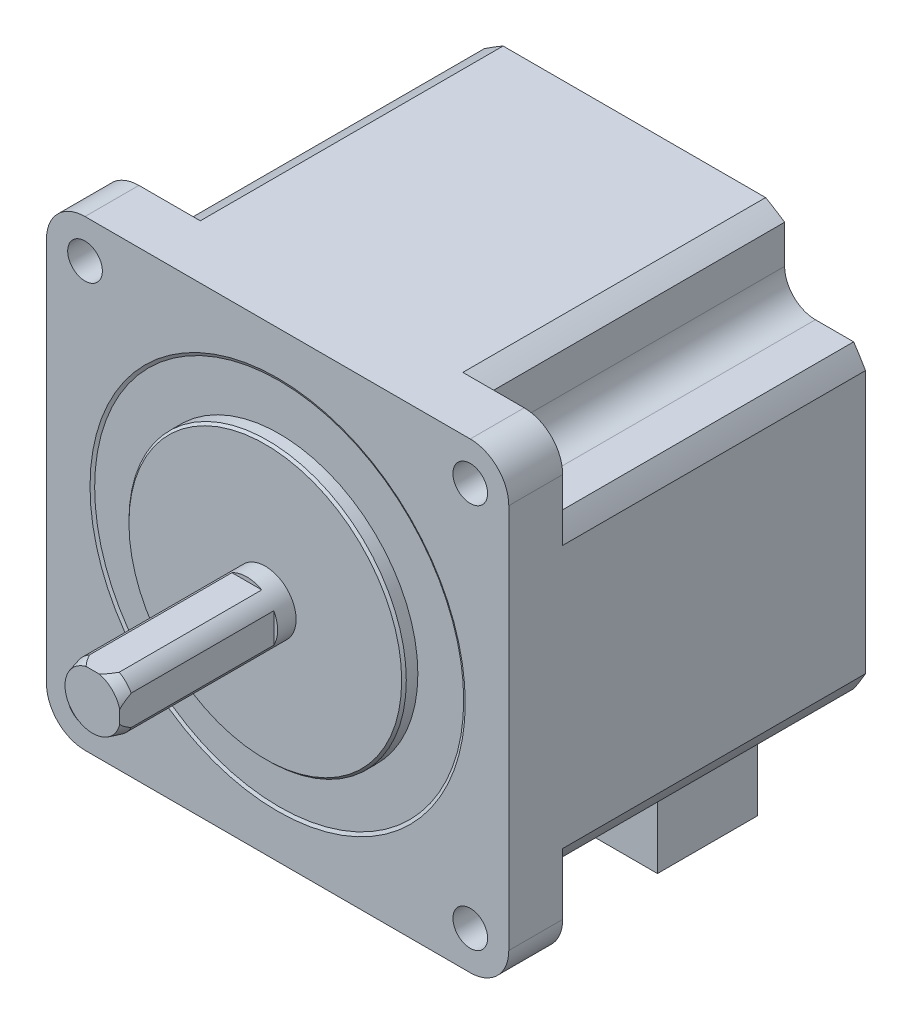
ISO-10303-21;
HEADER;
FILE_DESCRIPTION(('STEP AP214'),'2;1');
FILE_NAME('part.step','',(''),(''),'','','');
FILE_SCHEMA(('AUTOMOTIVE_DESIGN { 1 0 10303 214 1 1 1 1 }'));
ENDSEC;
DATA;
#1=APPLICATION_CONTEXT('core data for automotive mechanical design processes');
#2=APPLICATION_PROTOCOL_DEFINITION('international standard','automotive_design',2000,#1);
#3=PRODUCT_CONTEXT('',#1,'mechanical');
#4=PRODUCT('Part','Part','',(#3));
#5=PRODUCT_RELATED_PRODUCT_CATEGORY('part','',(#4));
#6=PRODUCT_DEFINITION_FORMATION('','',#4);
#7=PRODUCT_DEFINITION_CONTEXT('part definition',#1,'design');
#8=PRODUCT_DEFINITION('design','',#6,#7);
#9=PRODUCT_DEFINITION_SHAPE('','',#8);
#10=(LENGTH_UNIT() NAMED_UNIT(*) SI_UNIT(.MILLI.,.METRE.));
#11=(NAMED_UNIT(*) PLANE_ANGLE_UNIT() SI_UNIT($,.RADIAN.));
#12=(NAMED_UNIT(*) SI_UNIT($,.STERADIAN.) SOLID_ANGLE_UNIT());
#13=UNCERTAINTY_MEASURE_WITH_UNIT(LENGTH_MEASURE(1.E-05),#10,'distance_accuracy_value','');
#14=(GEOMETRIC_REPRESENTATION_CONTEXT(3) GLOBAL_UNCERTAINTY_ASSIGNED_CONTEXT((#13)) GLOBAL_UNIT_ASSIGNED_CONTEXT((#10,
#11,#12)) REPRESENTATION_CONTEXT('',''));
#15=CARTESIAN_POINT('',(0.,0.,0.));
#16=DIRECTION('',(0.,0.,1.));
#17=DIRECTION('',(1.,0.,0.));
#18=AXIS2_PLACEMENT_3D('',#15,#16,#17);
#19=CARTESIAN_POINT('',(0.,0.,22.4));
#20=DIRECTION('',(0.,0.,-1.));
#21=DIRECTION('',(-1.,0.,0.));
#22=AXIS2_PLACEMENT_3D('',#19,#20,#21);
#23=CONICAL_SURFACE('',#22,3.59807621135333,0.261799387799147);
#24=CARTESIAN_POINT('',(3.5,3.65885881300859,16.9316215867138));
#25=CARTESIAN_POINT('',(3.5,3.60239566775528,17.0838864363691));
#26=CARTESIAN_POINT('',(3.5,3.54539058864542,17.2359490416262));
#27=CARTESIAN_POINT('',(3.5,3.43012170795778,17.539604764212));
#28=CARTESIAN_POINT('',(3.5,3.37185784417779,17.6911978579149));
#29=CARTESIAN_POINT('',(3.5,3.19466893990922,18.1458077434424));
#30=CARTESIAN_POINT('',(3.5,3.07358949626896,18.4479953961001));
#31=CARTESIAN_POINT('',(3.5,2.88202757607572,18.9085831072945));
#32=CARTESIAN_POINT('',(3.5,2.81435636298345,19.0681529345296));
#33=CARTESIAN_POINT('',(3.5,2.67631316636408,19.3861181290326));
#34=CARTESIAN_POINT('',(3.5,2.60594127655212,19.5445135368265));
#35=CARTESIAN_POINT('',(3.5,2.46196785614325,19.8596093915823));
#36=CARTESIAN_POINT('',(3.5,2.3883702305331,20.0163116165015));
#37=CARTESIAN_POINT('',(3.5,2.23702965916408,20.327693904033));
#38=CARTESIAN_POINT('',(3.5,2.15928717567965,20.4823741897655));
#39=CARTESIAN_POINT('',(3.5,1.99956753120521,20.786779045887));
#40=CARTESIAN_POINT('',(3.5,1.91766524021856,20.9365427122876));
#41=CARTESIAN_POINT('',(3.5,1.74677024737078,21.2323903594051));
#42=CARTESIAN_POINT('',(3.5,1.65776561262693,21.3784675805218));
#43=CARTESIAN_POINT('',(3.5,1.51770774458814,21.5916740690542));
#44=CARTESIAN_POINT('',(3.5,1.47033809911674,21.6612195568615));
#45=CARTESIAN_POINT('',(3.5,1.37275172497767,21.7982748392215));
#46=CARTESIAN_POINT('',(3.5,1.32253564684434,21.8657850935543));
#47=CARTESIAN_POINT('',(3.5,1.21878037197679,21.997919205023));
#48=CARTESIAN_POINT('',(3.5,1.16525083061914,22.0625505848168));
#49=CARTESIAN_POINT('',(3.5,1.05398107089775,22.1880495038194));
#50=CARTESIAN_POINT('',(3.5,0.996243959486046,22.2489197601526));
#51=CARTESIAN_POINT('',(3.5,0.879074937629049,22.3618808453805));
#52=CARTESIAN_POINT('',(3.5,0.819941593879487,22.4142773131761));
#53=CARTESIAN_POINT('',(3.5,0.696050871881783,22.5121419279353));
#54=CARTESIAN_POINT('',(3.5,0.631293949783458,22.5576106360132));
#55=CARTESIAN_POINT('',(3.5,0.507273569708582,22.6311614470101));
#56=CARTESIAN_POINT('',(3.5,0.449006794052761,22.6608914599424));
#57=CARTESIAN_POINT('',(3.5,0.328412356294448,22.7105403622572));
#58=CARTESIAN_POINT('',(3.5,0.266093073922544,22.7304788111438));
#59=CARTESIAN_POINT('',(3.5,0.149648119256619,22.7555691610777));
#60=CARTESIAN_POINT('',(3.5,0.0959490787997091,22.7626698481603));
#61=CARTESIAN_POINT('',(3.5,-0.011869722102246,22.7674965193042));
#62=CARTESIAN_POINT('',(3.5,-0.0659893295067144,22.7652257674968));
#63=CARTESIAN_POINT('',(3.5,-0.172879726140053,22.7516191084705));
#64=CARTESIAN_POINT('',(3.5,-0.225653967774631,22.7403094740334));
#65=CARTESIAN_POINT('',(3.5,-0.328872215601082,22.7098978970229));
#66=CARTESIAN_POINT('',(3.5,-0.379314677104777,22.6907908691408));
#67=CARTESIAN_POINT('',(3.5,-0.508714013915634,22.6321380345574));
#68=CARTESIAN_POINT('',(3.5,-0.585263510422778,22.5873371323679));
#69=CARTESIAN_POINT('',(3.5,-0.730938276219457,22.4869137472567));
#70=CARTESIAN_POINT('',(3.5,-0.800033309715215,22.4312495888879));
#71=CARTESIAN_POINT('',(3.5,-0.955746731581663,22.2916879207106));
#72=CARTESIAN_POINT('',(3.5,-1.0396891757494,22.2048513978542));
#73=CARTESIAN_POINT('',(3.5,-1.19908801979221,22.0236161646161));
#74=CARTESIAN_POINT('',(3.5,-1.27452504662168,21.9292009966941));
#75=CARTESIAN_POINT('',(3.5,-1.41979524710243,21.7344953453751));
#76=CARTESIAN_POINT('',(3.5,-1.48955344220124,21.6341495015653));
#77=CARTESIAN_POINT('',(3.5,-1.62395149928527,21.4302869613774));
#78=CARTESIAN_POINT('',(3.5,-1.68859694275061,21.3267738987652));
#79=CARTESIAN_POINT('',(3.5,-1.85613404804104,21.0470251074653));
#80=CARTESIAN_POINT('',(3.5,-1.95551266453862,20.868694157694));
#81=CARTESIAN_POINT('',(3.5,-2.1466553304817,20.5079710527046));
#82=CARTESIAN_POINT('',(3.5,-2.23841606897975,20.3255771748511));
#83=CARTESIAN_POINT('',(3.5,-2.41645935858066,19.9576498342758));
#84=CARTESIAN_POINT('',(3.5,-2.50272932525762,19.7721103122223));
#85=CARTESIAN_POINT('',(3.5,-2.6709013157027,19.3990599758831));
#86=CARTESIAN_POINT('',(3.5,-2.75280305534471,19.2115490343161));
#87=CARTESIAN_POINT('',(3.5,-2.90658898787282,18.8504519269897));
#88=CARTESIAN_POINT('',(3.5,-2.97874468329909,18.6769809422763));
#89=CARTESIAN_POINT('',(3.5,-3.1206556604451,18.3290502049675));
#90=CARTESIAN_POINT('',(3.5,-3.19041080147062,18.1545903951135));
#91=CARTESIAN_POINT('',(3.5,-3.32757858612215,17.8057332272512));
#92=CARTESIAN_POINT('',(3.5,-3.3950009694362,17.6313396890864));
#93=CARTESIAN_POINT('',(3.5,-3.52813716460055,17.2819241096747));
#94=CARTESIAN_POINT('',(3.5,-3.59385117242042,17.1069021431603));
#95=CARTESIAN_POINT('',(3.5,-3.65885881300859,16.9316215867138));
#96=B_SPLINE_CURVE_WITH_KNOTS('',3,(#24,#25,#26,#27,#28,#29,#30,#31,#32,#33,#34,#35,#36,#37,#38,
#39,#40,#41,#42,#43,#44,#45,#46,#47,#48,#49,#50,#51,#52,#53,#54,#55,#56,#57,#58,#59,#60,#61,#62,
#63,#64,#65,#66,#67,#68,#69,#70,#71,#72,#73,#74,#75,#76,#77,#78,#79,#80,#81,#82,#83,#84,#85,#86,
#87,#88,#89,#90,#91,#92,#93,#94,#95),.UNSPECIFIED.,.F.,.F.,(4,2,2,2,2,2,2,2,2,2,2,2,2,2,2,2,2,2,
2,2,2,2,2,2,2,2,2,2,2,2,2,2,2,2,2,4),(0.,0.487185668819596,0.974395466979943,1.95092394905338,
2.47088362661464,2.99082527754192,3.51015400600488,4.0294249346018,4.54139798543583,
5.0542501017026,5.30663191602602,5.55895628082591,5.81057715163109,6.0620140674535,
6.29868754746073,6.53534184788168,6.73093008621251,6.92612601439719,7.08786234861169,
7.24954235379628,7.4107541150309,7.5720711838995,7.83661046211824,8.10218530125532,
8.46361083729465,8.82584364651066,9.19226963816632,9.55828992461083,10.1704387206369,
10.7828521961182,11.3966221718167,12.0104320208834,12.574048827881,13.1376986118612,
13.6986081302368,14.2594530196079),.UNSPECIFIED.);
#97=CARTESIAN_POINT('',(3.5,1.93649167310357,20.9000000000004));
#98=VERTEX_POINT('',#97);
#99=CARTESIAN_POINT('',(3.5,0.834357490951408,22.4));
#100=VERTEX_POINT('',#99);
#101=EDGE_CURVE('E305',#98,#100,#96,.T.);
#102=ORIENTED_EDGE('',*,*,#101,.F.);
#103=CARTESIAN_POINT('',(0.,0.,20.9));
#104=DIRECTION('',(0.,0.,1.));
#105=DIRECTION('',(1.,0.,0.));
#106=AXIS2_PLACEMENT_3D('',#103,#104,#105);
#107=CIRCLE('',#106,4.);
#108=CARTESIAN_POINT('',(1.93649167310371,3.5,20.9));
#109=VERTEX_POINT('',#108);
#110=EDGE_CURVE('E332',#109,#98,#107,.F.);
#111=ORIENTED_EDGE('',*,*,#110,.F.);
#112=CARTESIAN_POINT('',(-3.86930929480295,3.5,16.3564970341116));
#113=CARTESIAN_POINT('',(-3.8113068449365,3.5,16.5170199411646));
#114=CARTESIAN_POINT('',(-3.75279353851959,3.5,16.6773588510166));
#115=CARTESIAN_POINT('',(-3.63458077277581,3.5,16.9976052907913));
#116=CARTESIAN_POINT('',(-3.57488126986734,3.5,17.1575128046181));
#117=CARTESIAN_POINT('',(-3.39361030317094,3.5,17.6368798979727));
#118=CARTESIAN_POINT('',(-3.27001249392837,3.5,17.9555770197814));
#119=CARTESIAN_POINT('',(-3.01244232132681,3.5,18.5978750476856));
#120=CARTESIAN_POINT('',(-2.8782898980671,3.5,18.9214046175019));
#121=CARTESIAN_POINT('',(-2.66885480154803,3.5,19.4030223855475));
#122=CARTESIAN_POINT('',(-2.59769761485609,3.5,19.5629021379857));
#123=CARTESIAN_POINT('',(-2.45197127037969,3.5,19.8810939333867));
#124=CARTESIAN_POINT('',(-2.37740232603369,3.5,20.0394060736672));
#125=CARTESIAN_POINT('',(-2.22441816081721,3.5,20.3530265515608));
#126=CARTESIAN_POINT('',(-2.14602805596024,3.5,20.5083470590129));
#127=CARTESIAN_POINT('',(-1.98368792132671,3.5,20.816207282));
#128=CARTESIAN_POINT('',(-1.89973412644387,3.5,20.9687450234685));
#129=CARTESIAN_POINT('',(-1.72475802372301,3.5,21.2690282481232));
#130=CARTESIAN_POINT('',(-1.63376343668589,3.5,21.4167895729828));
#131=CARTESIAN_POINT('',(-1.48957033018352,3.5,21.6332031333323));
#132=CARTESIAN_POINT('',(-1.44025385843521,3.5,21.7044290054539));
#133=CARTESIAN_POINT('',(-1.33846826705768,3.5,21.8445807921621));
#134=CARTESIAN_POINT('',(-1.28599919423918,3.5,21.913506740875));
#135=CARTESIAN_POINT('',(-1.15028154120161,3.5,22.0816859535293));
#136=CARTESIAN_POINT('',(-1.06463830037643,3.5,22.1790896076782));
#137=CARTESIAN_POINT('',(-0.927427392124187,3.5,22.3162128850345));
#138=CARTESIAN_POINT('',(-0.880306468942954,3.5,22.3603667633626));
#139=CARTESIAN_POINT('',(-0.782611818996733,3.5,22.4446415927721));
#140=CARTESIAN_POINT('',(-0.732041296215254,3.5,22.4847662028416));
#141=CARTESIAN_POINT('',(-0.626326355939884,3.5,22.5599557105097));
#142=CARTESIAN_POINT('',(-0.571136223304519,3.5,22.5949574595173));
#143=CARTESIAN_POINT('',(-0.456439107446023,3.5,22.6571140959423));
#144=CARTESIAN_POINT('',(-0.396936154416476,3.5,22.6842761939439));
#145=CARTESIAN_POINT('',(-0.282931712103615,3.5,22.7248685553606));
#146=CARTESIAN_POINT('',(-0.228944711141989,3.5,22.7397133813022));
#147=CARTESIAN_POINT('',(-0.119250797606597,3.5,22.7600378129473));
#148=CARTESIAN_POINT('',(-0.0635463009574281,3.5,22.7655300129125));
#149=CARTESIAN_POINT('',(0.0480719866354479,3.5,22.7664569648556));
#150=CARTESIAN_POINT('',(0.103985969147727,3.5,22.7618697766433));
#151=CARTESIAN_POINT('',(0.214216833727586,3.5,22.7432034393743));
#152=CARTESIAN_POINT('',(0.26853159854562,3.5,22.7291122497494));
#153=CARTESIAN_POINT('',(0.392914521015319,3.5,22.6866590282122));
#154=CARTESIAN_POINT('',(0.461848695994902,3.5,22.6550295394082));
#155=CARTESIAN_POINT('',(0.593979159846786,3.5,22.5815220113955));
#156=CARTESIAN_POINT('',(0.657160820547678,3.5,22.5396187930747));
#157=CARTESIAN_POINT('',(0.775505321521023,3.5,22.4508929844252));
#158=CARTESIAN_POINT('',(0.830900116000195,3.5,22.4043731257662));
#159=CARTESIAN_POINT('',(0.937609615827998,3.5,22.3068263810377));
#160=CARTESIAN_POINT('',(0.988920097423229,3.5,22.2557949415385));
#161=CARTESIAN_POINT('',(1.08824660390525,3.5,22.1503476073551));
#162=CARTESIAN_POINT('',(1.13625167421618,3.5,22.0959215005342));
#163=CARTESIAN_POINT('',(1.22933749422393,3.5,21.9846920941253));
#164=CARTESIAN_POINT('',(1.27441975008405,3.5,21.9278900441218));
#165=CARTESIAN_POINT('',(1.40470096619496,3.5,21.7565363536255));
#166=CARTESIAN_POINT('',(1.48644178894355,3.5,21.6393610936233));
#167=CARTESIAN_POINT('',(1.64319201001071,3.5,21.4005598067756));
#168=CARTESIAN_POINT('',(1.71819627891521,3.5,21.2789304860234));
#169=CARTESIAN_POINT('',(1.86323185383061,3.5,21.0323940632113));
#170=CARTESIAN_POINT('',(1.93325170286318,3.5,20.9074802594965));
#171=CARTESIAN_POINT('',(2.06928175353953,3.5,20.6554785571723));
#172=CARTESIAN_POINT('',(2.13529130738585,3.5,20.5283903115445));
#173=CARTESIAN_POINT('',(2.26442116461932,3.5,20.2719514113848));
#174=CARTESIAN_POINT('',(2.32752509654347,3.5,20.1425925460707));
#175=CARTESIAN_POINT('',(2.45107743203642,3.5,19.882609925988));
#176=CARTESIAN_POINT('',(2.51152569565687,3.5,19.7519861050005));
#177=CARTESIAN_POINT('',(2.6894180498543,3.5,19.3589924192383));
#178=CARTESIAN_POINT('',(2.8035874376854,3.5,19.0951401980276));
#179=CARTESIAN_POINT('',(3.00048591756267,3.5,18.6248626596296));
#180=CARTESIAN_POINT('',(3.08448097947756,3.5,18.4189605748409));
#181=CARTESIAN_POINT('',(3.24945704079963,3.5,18.0058641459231));
#182=CARTESIAN_POINT('',(3.33043691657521,3.5,17.7986693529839));
#183=CARTESIAN_POINT('',(3.48887984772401,3.5,17.3860176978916));
#184=CARTESIAN_POINT('',(3.56637485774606,3.5,17.1805730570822));
#185=CARTESIAN_POINT('',(3.71929183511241,3.5,16.7690161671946));
#186=CARTESIAN_POINT('',(3.79471470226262,3.5,16.5629042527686));
#187=CARTESIAN_POINT('',(3.86930929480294,3.5,16.3564970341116));
#188=B_SPLINE_CURVE_WITH_KNOTS('',3,(#112,#113,#114,#115,#116,#117,#118,#119,#120,#121,#122,
#123,#124,#125,#126,#127,#128,#129,#130,#131,#132,#133,#134,#135,#136,#137,#138,#139,#140,#141,
#142,#143,#144,#145,#146,#147,#148,#149,#150,#151,#152,#153,#154,#155,#156,#157,#158,#159,#160,
#161,#162,#163,#164,#165,#166,#167,#168,#169,#170,#171,#172,#173,#174,#175,#176,#177,#178,#179,
#180,#181,#182,#183,#184,#185,#186,#187),.UNSPECIFIED.,.F.,.F.,(4,2,2,2,2,2,2,2,2,2,2,2,2,2,2,2,
2,2,2,2,2,2,2,2,2,2,2,2,2,2,2,2,2,2,2,2,2,4),(0.,0.512041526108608,1.02410189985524,
2.04951981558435,3.10007779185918,3.62504636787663,4.14998214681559,4.67184000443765,
5.19405469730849,5.71430882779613,5.97412878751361,6.2339448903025,6.62218502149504,
6.81575137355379,7.00914032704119,7.20474211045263,7.40016340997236,7.56743042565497,
7.73447202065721,7.90187758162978,8.06949562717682,8.29573563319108,8.52253575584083,
8.73922123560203,8.95612796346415,9.17372201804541,9.39120303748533,9.81942658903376,
10.247973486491,10.6774755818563,11.1070468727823,11.5387992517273,11.9705743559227,
12.8329204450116,13.500025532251,14.1673767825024,14.8260894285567,15.4845113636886),.UNSPECIFIED.);
#189=CARTESIAN_POINT('',(0.834357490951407,3.5,22.4));
#190=VERTEX_POINT('',#189);
#191=EDGE_CURVE('E324',#190,#109,#188,.T.);
#192=ORIENTED_EDGE('',*,*,#191,.F.);
#193=CARTESIAN_POINT('',(0.,0.,22.4));
#194=DIRECTION('',(0.,0.,1.));
#195=DIRECTION('',(1.,0.,0.));
#196=AXIS2_PLACEMENT_3D('',#193,#194,#195);
#197=CIRCLE('',#196,3.59807621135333);
#198=EDGE_CURVE('E59',#100,#190,#197,.T.);
#199=ORIENTED_EDGE('',*,*,#198,.F.);
#200=EDGE_LOOP('',(#102,#111,#192,#199));
#201=FACE_BOUND('',#200,.T.);
#202=ADVANCED_FACE('F37',(#201),#23,.T.);
#203=CARTESIAN_POINT('',(0.,0.,22.4));
#204=DIRECTION('',(0.,0.,-1.));
#205=DIRECTION('',(-1.,0.,0.));
#206=AXIS2_PLACEMENT_3D('',#203,#204,#205);
#207=CYLINDRICAL_SURFACE('',#206,4.);
#208=ORIENTED_EDGE('',*,*,#110,.T.);
#209=DIRECTION('',(0.,0.,-1.));
#210=VECTOR('',#209,1.);
#211=CARTESIAN_POINT('',(3.5,1.93649167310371,22.4));
#212=LINE('',#211,#210);
#213=CARTESIAN_POINT('',(3.5,1.93649167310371,2.4));
#214=VERTEX_POINT('',#213);
#215=EDGE_CURVE('E309',#98,#214,#212,.T.);
#216=ORIENTED_EDGE('',*,*,#215,.T.);
#217=CARTESIAN_POINT('',(0.,0.,2.4));
#218=DIRECTION('',(0.,0.,-1.));
#219=DIRECTION('',(-1.,0.,0.));
#220=AXIS2_PLACEMENT_3D('',#217,#218,#219);
#221=CIRCLE('',#220,4.);
#222=CARTESIAN_POINT('',(3.5,-1.93649167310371,2.4));
#223=VERTEX_POINT('',#222);
#224=EDGE_CURVE('E313',#214,#223,#221,.T.);
#225=ORIENTED_EDGE('',*,*,#224,.T.);
#226=DIRECTION('',(0.,0.,-1.));
#227=VECTOR('',#226,1.);
#228=CARTESIAN_POINT('',(3.5,-1.93649167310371,22.4));
#229=LINE('',#228,#227);
#230=CARTESIAN_POINT('',(3.5,-1.93649167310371,20.9));
#231=VERTEX_POINT('',#230);
#232=EDGE_CURVE('E547',#223,#231,#229,.F.);
#233=ORIENTED_EDGE('',*,*,#232,.T.);
#234=CARTESIAN_POINT('',(-1.93649167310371,3.5,20.9));
#235=VERTEX_POINT('',#234);
#236=EDGE_CURVE('E327',#231,#235,#107,.F.);
#237=ORIENTED_EDGE('',*,*,#236,.T.);
#238=DIRECTION('',(0.,0.,-1.));
#239=VECTOR('',#238,1.);
#240=CARTESIAN_POINT('',(-1.93649167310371,3.5,22.4));
#241=LINE('',#240,#239);
#242=CARTESIAN_POINT('',(-1.93649167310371,3.5,2.4));
#243=VERTEX_POINT('',#242);
#244=EDGE_CURVE('E559',#235,#243,#241,.T.);
#245=ORIENTED_EDGE('',*,*,#244,.T.);
#246=CARTESIAN_POINT('',(0.,0.,2.4));
#247=DIRECTION('',(0.,0.,1.));
#248=DIRECTION('',(1.,0.,0.));
#249=AXIS2_PLACEMENT_3D('',#246,#247,#248);
#250=CIRCLE('',#249,4.);
#251=CARTESIAN_POINT('',(1.93649167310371,3.5,2.4));
#252=VERTEX_POINT('',#251);
#253=EDGE_CURVE('E341',#252,#243,#250,.T.);
#254=ORIENTED_EDGE('',*,*,#253,.F.);
#255=DIRECTION('',(0.,0.,-1.));
#256=VECTOR('',#255,1.);
#257=CARTESIAN_POINT('',(1.93649167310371,3.5,22.4));
#258=LINE('',#257,#256);
#259=EDGE_CURVE('E555',#252,#109,#258,.F.);
#260=ORIENTED_EDGE('',*,*,#259,.T.);
#261=EDGE_LOOP('',(#208,#216,#225,#233,#237,#245,#254,#260));
#262=FACE_BOUND('',#261,.T.);
#263=CARTESIAN_POINT('',(0.,0.,0.));
#264=DIRECTION('',(0.,0.,-1.));
#265=DIRECTION('',(-1.,0.,0.));
#266=AXIS2_PLACEMENT_3D('',#263,#264,#265);
#267=CIRCLE('',#266,4.);
#268=CARTESIAN_POINT('',(-4.,0.,0.));
#269=VERTEX_POINT('',#268);
#270=EDGE_CURVE('E785',#269,#269,#267,.T.);
#271=ORIENTED_EDGE('',*,*,#270,.F.);
#272=EDGE_LOOP('',(#271));
#273=FACE_BOUND('',#272,.T.);
#274=ADVANCED_FACE('F477',(#262,#273),#207,.T.);
#275=CARTESIAN_POINT('',(0.,0.,22.4));
#276=DIRECTION('',(0.,0.,1.));
#277=DIRECTION('',(1.,0.,0.));
#278=AXIS2_PLACEMENT_3D('',#275,#276,#277);
#279=PLANE('',#278);
#280=DIRECTION('',(0.,-1.,0.));
#281=VECTOR('',#280,1.);
#282=CARTESIAN_POINT('',(3.5,2.44128177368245,22.4));
#283=LINE('',#282,#281);
#284=CARTESIAN_POINT('',(3.5,-0.834357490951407,22.4));
#285=VERTEX_POINT('',#284);
#286=EDGE_CURVE('E52',#100,#285,#283,.T.);
#287=ORIENTED_EDGE('',*,*,#286,.F.);
#288=ORIENTED_EDGE('',*,*,#198,.T.);
#289=DIRECTION('',(1.,0.,0.));
#290=VECTOR('',#289,1.);
#291=CARTESIAN_POINT('',(-4.72781232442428,3.5,22.4));
#292=LINE('',#291,#290);
#293=CARTESIAN_POINT('',(-0.834357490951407,3.5,22.4));
#294=VERTEX_POINT('',#293);
#295=EDGE_CURVE('E551',#294,#190,#292,.T.);
#296=ORIENTED_EDGE('',*,*,#295,.F.);
#297=EDGE_CURVE('E319',#294,#285,#197,.T.);
#298=ORIENTED_EDGE('',*,*,#297,.T.);
#299=EDGE_LOOP('',(#287,#288,#296,#298));
#300=FACE_BOUND('',#299,.T.);
#301=ADVANCED_FACE('F317',(#300),#279,.T.);
#302=CARTESIAN_POINT('',(0.,0.,0.));
#303=DIRECTION('',(0.,0.,-1.));
#304=DIRECTION('',(-1.,0.,0.));
#305=AXIS2_PLACEMENT_3D('',#302,#303,#304);
#306=PLANE('',#305);
#307=CARTESIAN_POINT('',(0.,0.,0.));
#308=DIRECTION('',(0.,0.,-1.));
#309=DIRECTION('',(-1.,0.,0.));
#310=AXIS2_PLACEMENT_3D('',#307,#308,#309);
#311=CIRCLE('',#310,17.7);
#312=CARTESIAN_POINT('',(-17.7,0.,0.));
#313=VERTEX_POINT('',#312);
#314=EDGE_CURVE('E45',#313,#313,#311,.F.);
#315=ORIENTED_EDGE('',*,*,#314,.T.);
#316=EDGE_LOOP('',(#315));
#317=FACE_BOUND('',#316,.T.);
#318=ORIENTED_EDGE('',*,*,#270,.T.);
#319=EDGE_LOOP('',(#318));
#320=FACE_BOUND('',#319,.T.);
#321=ADVANCED_FACE('F467',(#317,#320),#306,.F.);
#322=CARTESIAN_POINT('',(0.,0.,-1.6));
#323=DIRECTION('',(0.,0.,1.));
#324=DIRECTION('',(1.,0.,0.));
#325=AXIS2_PLACEMENT_3D('',#322,#323,#324);
#326=CYLINDRICAL_SURFACE('',#325,18.);
#327=CARTESIAN_POINT('',(0.,0.,-0.300000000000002));
#328=DIRECTION('',(0.,0.,-1.));
#329=DIRECTION('',(-1.,0.,0.));
#330=AXIS2_PLACEMENT_3D('',#327,#328,#329);
#331=CIRCLE('',#330,18.);
#332=CARTESIAN_POINT('',(-18.,0.,-0.300000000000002));
#333=VERTEX_POINT('',#332);
#334=EDGE_CURVE('E1384',#333,#333,#331,.T.);
#335=ORIENTED_EDGE('',*,*,#334,.T.);
#336=EDGE_LOOP('',(#335));
#337=FACE_BOUND('',#336,.T.);
#338=CARTESIAN_POINT('',(0.,0.,-1.8));
#339=DIRECTION('',(0.,0.,1.));
#340=DIRECTION('',(1.,0.,0.));
#341=AXIS2_PLACEMENT_3D('',#338,#339,#340);
#342=CIRCLE('',#341,18.);
#343=CARTESIAN_POINT('',(18.,0.,-1.8));
#344=VERTEX_POINT('',#343);
#345=EDGE_CURVE('E540',#344,#344,#342,.T.);
#346=ORIENTED_EDGE('',*,*,#345,.T.);
#347=EDGE_LOOP('',(#346));
#348=FACE_BOUND('',#347,.T.);
#349=ADVANCED_FACE('F470',(#337,#348),#326,.T.);
#350=EDGE_CURVE('E314',#285,#231,#96,.T.);
#351=ORIENTED_EDGE('',*,*,#350,.F.);
#352=ORIENTED_EDGE('',*,*,#297,.F.);
#353=EDGE_CURVE('E340',#235,#294,#188,.T.);
#354=ORIENTED_EDGE('',*,*,#353,.F.);
#355=ORIENTED_EDGE('',*,*,#236,.F.);
#356=EDGE_LOOP('',(#351,#352,#354,#355));
#357=FACE_BOUND('',#356,.T.);
#358=ADVANCED_FACE('F342',(#357),#23,.T.);
#359=CARTESIAN_POINT('',(0.,0.,2.4));
#360=DIRECTION('',(0.,0.,1.));
#361=DIRECTION('',(1.,0.,0.));
#362=AXIS2_PLACEMENT_3D('',#359,#360,#361);
#363=PLANE('',#362);
#364=ORIENTED_EDGE('',*,*,#253,.T.);
#365=DIRECTION('',(1.,0.,0.));
#366=VECTOR('',#365,1.);
#367=CARTESIAN_POINT('',(-4.72781232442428,3.5,2.4));
#368=LINE('',#367,#366);
#369=EDGE_CURVE('E552',#243,#252,#368,.T.);
#370=ORIENTED_EDGE('',*,*,#369,.T.);
#371=EDGE_LOOP('',(#364,#370));
#372=FACE_BOUND('',#371,.T.);
#373=ADVANCED_FACE('F351',(#372),#363,.T.);
#374=CARTESIAN_POINT('',(-4.72781232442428,3.5,2.4));
#375=DIRECTION('',(0.,-1.,0.));
#376=DIRECTION('',(0.,0.,-1.));
#377=AXIS2_PLACEMENT_3D('',#374,#375,#376);
#378=PLANE('',#377);
#379=ORIENTED_EDGE('',*,*,#353,.T.);
#380=ORIENTED_EDGE('',*,*,#295,.T.);
#381=ORIENTED_EDGE('',*,*,#191,.T.);
#382=ORIENTED_EDGE('',*,*,#259,.F.);
#383=ORIENTED_EDGE('',*,*,#369,.F.);
#384=ORIENTED_EDGE('',*,*,#244,.F.);
#385=EDGE_LOOP('',(#379,#380,#381,#382,#383,#384));
#386=FACE_BOUND('',#385,.T.);
#387=ADVANCED_FACE('F345',(#386),#378,.F.);
#388=CARTESIAN_POINT('',(0.,0.,2.4));
#389=DIRECTION('',(0.,0.,-1.));
#390=DIRECTION('',(-1.,0.,0.));
#391=AXIS2_PLACEMENT_3D('',#388,#389,#390);
#392=PLANE('',#391);
#393=DIRECTION('',(0.,-1.,0.));
#394=VECTOR('',#393,1.);
#395=CARTESIAN_POINT('',(3.5,2.44128177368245,2.4));
#396=LINE('',#395,#394);
#397=EDGE_CURVE('E320',#214,#223,#396,.T.);
#398=ORIENTED_EDGE('',*,*,#397,.T.);
#399=ORIENTED_EDGE('',*,*,#224,.F.);
#400=EDGE_LOOP('',(#398,#399));
#401=FACE_BOUND('',#400,.T.);
#402=ADVANCED_FACE('F350',(#401),#392,.F.);
#403=CARTESIAN_POINT('',(3.5,2.44128177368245,2.4));
#404=DIRECTION('',(-1.,0.,0.));
#405=DIRECTION('',(0.,-1.,0.));
#406=AXIS2_PLACEMENT_3D('',#403,#404,#405);
#407=PLANE('',#406);
#408=ORIENTED_EDGE('',*,*,#101,.T.);
#409=ORIENTED_EDGE('',*,*,#286,.T.);
#410=ORIENTED_EDGE('',*,*,#350,.T.);
#411=ORIENTED_EDGE('',*,*,#232,.F.);
#412=ORIENTED_EDGE('',*,*,#397,.F.);
#413=ORIENTED_EDGE('',*,*,#215,.F.);
#414=EDGE_LOOP('',(#408,#409,#410,#411,#412,#413));
#415=FACE_BOUND('',#414,.T.);
#416=ADVANCED_FACE('F306',(#415),#407,.F.);
#417=CARTESIAN_POINT('',(0.,0.,-0.300000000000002));
#418=DIRECTION('',(0.,0.,-1.));
#419=DIRECTION('',(-1.,0.,0.));
#420=AXIS2_PLACEMENT_3D('',#417,#418,#419);
#421=CONICAL_SURFACE('',#420,18.,0.785398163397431);
#422=ORIENTED_EDGE('',*,*,#314,.F.);
#423=EDGE_LOOP('',(#422));
#424=FACE_BOUND('',#423,.T.);
#425=ORIENTED_EDGE('',*,*,#334,.F.);
#426=EDGE_LOOP('',(#425));
#427=FACE_BOUND('',#426,.T.);
#428=ADVANCED_FACE('F526',(#424,#427),#421,.T.);
#429=CARTESIAN_POINT('',(0.,0.,-1.8));
#430=DIRECTION('',(0.,0.,1.));
#431=DIRECTION('',(1.,0.,0.));
#432=AXIS2_PLACEMENT_3D('',#429,#430,#431);
#433=PLANE('',#432);
#434=CARTESIAN_POINT('',(0.,0.,-1.8));
#435=DIRECTION('',(0.,0.,1.));
#436=DIRECTION('',(1.,0.,0.));
#437=AXIS2_PLACEMENT_3D('',#434,#435,#436);
#438=CIRCLE('',#437,23.95);
#439=CARTESIAN_POINT('',(23.95,0.,-1.8));
#440=VERTEX_POINT('',#439);
#441=EDGE_CURVE('E11',#440,#440,#438,.T.);
#442=ORIENTED_EDGE('',*,*,#441,.T.);
#443=EDGE_LOOP('',(#442));
#444=FACE_BOUND('',#443,.T.);
#445=ORIENTED_EDGE('',*,*,#345,.F.);
#446=EDGE_LOOP('',(#445));
#447=FACE_BOUND('',#446,.T.);
#448=ADVANCED_FACE('F389',(#444,#447),#433,.T.);
#449=CARTESIAN_POINT('',(0.,-19.4999999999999,-47.9));
#450=DIRECTION('',(0.,1.,0.));
#451=DIRECTION('',(-1.,0.,0.));
#452=AXIS2_PLACEMENT_3D('',#449,#450,#451);
#453=PLANE('',#452);
#454=DIRECTION('',(-1.,0.,0.));
#455=VECTOR('',#454,1.);
#456=CARTESIAN_POINT('',(0.,-19.4999999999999,-47.9));
#457=LINE('',#456,#455);
#458=CARTESIAN_POINT('',(-23.5,-19.5,-47.9));
#459=VERTEX_POINT('',#458);
#460=CARTESIAN_POINT('',(-28.4604989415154,-19.5,-47.9));
#461=VERTEX_POINT('',#460);
#462=EDGE_CURVE('E629',#459,#461,#457,.T.);
#463=ORIENTED_EDGE('',*,*,#462,.F.);
#464=DIRECTION('',(0.,0.,1.));
#465=VECTOR('',#464,1.);
#466=CARTESIAN_POINT('',(-23.5,-19.5,-47.9));
#467=LINE('',#466,#465);
#468=CARTESIAN_POINT('',(-23.5,-19.5,-8.6));
#469=VERTEX_POINT('',#468);
#470=EDGE_CURVE('E695',#459,#469,#467,.T.);
#471=ORIENTED_EDGE('',*,*,#470,.T.);
#472=DIRECTION('',(-1.,0.,0.));
#473=VECTOR('',#472,1.);
#474=CARTESIAN_POINT('',(0.,-19.4999999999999,-8.6));
#475=LINE('',#474,#473);
#476=CARTESIAN_POINT('',(-28.4604989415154,-19.5,-8.6));
#477=VERTEX_POINT('',#476);
#478=EDGE_CURVE('E869',#469,#477,#475,.T.);
#479=ORIENTED_EDGE('',*,*,#478,.T.);
#480=DIRECTION('',(0.,0.,1.));
#481=VECTOR('',#480,1.);
#482=CARTESIAN_POINT('',(-28.4604989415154,-19.5,-47.9));
#483=LINE('',#482,#481);
#484=EDGE_CURVE('E871',#461,#477,#483,.T.);
#485=ORIENTED_EDGE('',*,*,#484,.F.);
#486=EDGE_LOOP('',(#463,#471,#479,#485));
#487=FACE_BOUND('',#486,.T.);
#488=ADVANCED_FACE('F385',(#487),#453,.F.);
#489=CARTESIAN_POINT('',(-23.5,-23.5,-47.9));
#490=DIRECTION('',(0.,0.,1.));
#491=DIRECTION('',(1.,0.,0.));
#492=AXIS2_PLACEMENT_3D('',#489,#490,#491);
#493=CYLINDRICAL_SURFACE('',#492,4.);
#494=CARTESIAN_POINT('',(-23.5,-23.5,-47.9));
#495=DIRECTION('',(0.,0.,-1.));
#496=DIRECTION('',(-1.,0.,0.));
#497=AXIS2_PLACEMENT_3D('',#494,#495,#496);
#498=CIRCLE('',#497,4.);
#499=CARTESIAN_POINT('',(-19.5,-23.5,-47.9));
#500=VERTEX_POINT('',#499);
#501=EDGE_CURVE('E718',#500,#459,#498,.F.);
#502=ORIENTED_EDGE('',*,*,#501,.F.);
#503=DIRECTION('',(0.,0.,1.));
#504=VECTOR('',#503,1.);
#505=CARTESIAN_POINT('',(-19.5,-23.5,-47.9));
#506=LINE('',#505,#504);
#507=CARTESIAN_POINT('',(-19.5,-23.5,-8.6));
#508=VERTEX_POINT('',#507);
#509=EDGE_CURVE('E700',#508,#500,#506,.F.);
#510=ORIENTED_EDGE('',*,*,#509,.F.);
#511=CARTESIAN_POINT('',(-23.5,-23.5,-8.6));
#512=DIRECTION('',(0.,0.,-1.));
#513=DIRECTION('',(-1.,0.,0.));
#514=AXIS2_PLACEMENT_3D('',#511,#512,#513);
#515=CIRCLE('',#514,4.);
#516=EDGE_CURVE('E698',#469,#508,#515,.T.);
#517=ORIENTED_EDGE('',*,*,#516,.F.);
#518=ORIENTED_EDGE('',*,*,#470,.F.);
#519=EDGE_LOOP('',(#502,#510,#517,#518));
#520=FACE_BOUND('',#519,.T.);
#521=ADVANCED_FACE('F388',(#520),#493,.F.);
#522=CARTESIAN_POINT('',(-19.5,0.,-47.9));
#523=DIRECTION('',(-1.,0.,0.));
#524=DIRECTION('',(0.,-1.,0.));
#525=AXIS2_PLACEMENT_3D('',#522,#523,#524);
#526=PLANE('',#525);
#527=DIRECTION('',(0.,-1.,0.));
#528=VECTOR('',#527,1.);
#529=CARTESIAN_POINT('',(-19.5,0.,-8.6));
#530=LINE('',#529,#528);
#531=CARTESIAN_POINT('',(-19.5,-28.4604989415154,-8.6));
#532=VERTEX_POINT('',#531);
#533=EDGE_CURVE('E867',#508,#532,#530,.T.);
#534=ORIENTED_EDGE('',*,*,#533,.F.);
#535=ORIENTED_EDGE('',*,*,#509,.T.);
#536=DIRECTION('',(0.,-1.,0.));
#537=VECTOR('',#536,1.);
#538=CARTESIAN_POINT('',(-19.5,0.,-47.9));
#539=LINE('',#538,#537);
#540=CARTESIAN_POINT('',(-19.5,-28.4604989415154,-47.9));
#541=VERTEX_POINT('',#540);
#542=EDGE_CURVE('E627',#500,#541,#539,.T.);
#543=ORIENTED_EDGE('',*,*,#542,.T.);
#544=DIRECTION('',(0.,0.,1.));
#545=VECTOR('',#544,1.);
#546=CARTESIAN_POINT('',(-19.5,-28.4604989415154,-47.9));
#547=LINE('',#546,#545);
#548=EDGE_CURVE('E874',#541,#532,#547,.T.);
#549=ORIENTED_EDGE('',*,*,#548,.T.);
#550=EDGE_LOOP('',(#534,#535,#543,#549));
#551=FACE_BOUND('',#550,.T.);
#552=ADVANCED_FACE('F391',(#551),#526,.T.);
#553=CARTESIAN_POINT('',(-19.5,0.,-47.9));
#554=DIRECTION('',(-1.,0.,0.));
#555=DIRECTION('',(0.,-1.,0.));
#556=AXIS2_PLACEMENT_3D('',#553,#554,#555);
#557=PLANE('',#556);
#558=DIRECTION('',(0.,-1.,0.));
#559=VECTOR('',#558,1.);
#560=CARTESIAN_POINT('',(-19.5,0.,-47.9));
#561=LINE('',#560,#559);
#562=CARTESIAN_POINT('',(-19.5,28.4604989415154,-47.9));
#563=VERTEX_POINT('',#562);
#564=CARTESIAN_POINT('',(-19.5,23.5,-47.9));
#565=VERTEX_POINT('',#564);
#566=EDGE_CURVE('E600',#563,#565,#561,.T.);
#567=ORIENTED_EDGE('',*,*,#566,.T.);
#568=DIRECTION('',(0.,0.,1.));
#569=VECTOR('',#568,1.);
#570=CARTESIAN_POINT('',(-19.5,23.5,-8.6));
#571=LINE('',#570,#569);
#572=CARTESIAN_POINT('',(-19.5,23.5,-8.6));
#573=VERTEX_POINT('',#572);
#574=EDGE_CURVE('E702',#565,#573,#571,.T.);
#575=ORIENTED_EDGE('',*,*,#574,.T.);
#576=DIRECTION('',(0.,-1.,0.));
#577=VECTOR('',#576,1.);
#578=CARTESIAN_POINT('',(-19.5,0.,-8.6));
#579=LINE('',#578,#577);
#580=CARTESIAN_POINT('',(-19.5,28.4604989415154,-8.6));
#581=VERTEX_POINT('',#580);
#582=EDGE_CURVE('E681',#581,#573,#579,.T.);
#583=ORIENTED_EDGE('',*,*,#582,.F.);
#584=DIRECTION('',(0.,0.,1.));
#585=VECTOR('',#584,1.);
#586=CARTESIAN_POINT('',(-19.5,28.4604989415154,-47.9));
#587=LINE('',#586,#585);
#588=EDGE_CURVE('E684',#563,#581,#587,.T.);
#589=ORIENTED_EDGE('',*,*,#588,.F.);
#590=EDGE_LOOP('',(#567,#575,#583,#589));
#591=FACE_BOUND('',#590,.T.);
#592=ADVANCED_FACE('F394',(#591),#557,.T.);
#593=CARTESIAN_POINT('',(-23.5,23.5,-47.9));
#594=DIRECTION('',(0.,0.,-1.));
#595=DIRECTION('',(-1.,0.,0.));
#596=AXIS2_PLACEMENT_3D('',#593,#594,#595);
#597=CYLINDRICAL_SURFACE('',#596,4.);
#598=CARTESIAN_POINT('',(-23.5,23.5,-47.9));
#599=DIRECTION('',(0.,0.,-1.));
#600=DIRECTION('',(-1.,0.,0.));
#601=AXIS2_PLACEMENT_3D('',#598,#599,#600);
#602=CIRCLE('',#601,4.);
#603=CARTESIAN_POINT('',(-23.5,19.5,-47.9));
#604=VERTEX_POINT('',#603);
#605=EDGE_CURVE('E328',#604,#565,#602,.F.);
#606=ORIENTED_EDGE('',*,*,#605,.F.);
#607=DIRECTION('',(0.,0.,1.));
#608=VECTOR('',#607,1.);
#609=CARTESIAN_POINT('',(-23.5,19.5,-47.9));
#610=LINE('',#609,#608);
#611=CARTESIAN_POINT('',(-23.5,19.5,-8.6));
#612=VERTEX_POINT('',#611);
#613=EDGE_CURVE('E707',#612,#604,#610,.F.);
#614=ORIENTED_EDGE('',*,*,#613,.F.);
#615=CARTESIAN_POINT('',(-23.5,23.5,-8.6));
#616=DIRECTION('',(0.,0.,-1.));
#617=DIRECTION('',(-1.,0.,0.));
#618=AXIS2_PLACEMENT_3D('',#615,#616,#617);
#619=CIRCLE('',#618,4.);
#620=EDGE_CURVE('E705',#573,#612,#619,.T.);
#621=ORIENTED_EDGE('',*,*,#620,.F.);
#622=ORIENTED_EDGE('',*,*,#574,.F.);
#623=EDGE_LOOP('',(#606,#614,#621,#622));
#624=FACE_BOUND('',#623,.T.);
#625=ADVANCED_FACE('F414',(#624),#597,.F.);
#626=CARTESIAN_POINT('',(0.,19.5000000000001,-47.9));
#627=DIRECTION('',(0.,1.,0.));
#628=DIRECTION('',(-1.,0.,0.));
#629=AXIS2_PLACEMENT_3D('',#626,#627,#628);
#630=PLANE('',#629);
#631=DIRECTION('',(-1.,0.,0.));
#632=VECTOR('',#631,1.);
#633=CARTESIAN_POINT('',(0.,19.5000000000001,-8.6));
#634=LINE('',#633,#632);
#635=CARTESIAN_POINT('',(-28.4604989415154,19.5,-8.6));
#636=VERTEX_POINT('',#635);
#637=EDGE_CURVE('E633',#612,#636,#634,.T.);
#638=ORIENTED_EDGE('',*,*,#637,.F.);
#639=ORIENTED_EDGE('',*,*,#613,.T.);
#640=DIRECTION('',(-1.,0.,0.));
#641=VECTOR('',#640,1.);
#642=CARTESIAN_POINT('',(0.,19.5000000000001,-47.9));
#643=LINE('',#642,#641);
#644=CARTESIAN_POINT('',(-28.4604989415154,19.5,-47.9));
#645=VERTEX_POINT('',#644);
#646=EDGE_CURVE('E596',#604,#645,#643,.T.);
#647=ORIENTED_EDGE('',*,*,#646,.T.);
#648=DIRECTION('',(0.,0.,1.));
#649=VECTOR('',#648,1.);
#650=CARTESIAN_POINT('',(-28.4604989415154,19.5,-47.9));
#651=LINE('',#650,#649);
#652=EDGE_CURVE('E732',#645,#636,#651,.T.);
#653=ORIENTED_EDGE('',*,*,#652,.T.);
#654=EDGE_LOOP('',(#638,#639,#647,#653));
#655=FACE_BOUND('',#654,.T.);
#656=ADVANCED_FACE('F358',(#655),#630,.T.);
#657=CARTESIAN_POINT('',(0.,-40.,0.));
#658=DIRECTION('',(0.,1.,0.));
#659=DIRECTION('',(0.,0.,1.));
#660=AXIS2_PLACEMENT_3D('',#657,#658,#659);
#661=PLANE('',#660);
#662=DIRECTION('',(0.,0.,-1.));
#663=VECTOR('',#662,1.);
#664=CARTESIAN_POINT('',(-16.,-40.,-47.9));
#665=LINE('',#664,#663);
#666=CARTESIAN_POINT('',(-16.,-40.,-34.9));
#667=VERTEX_POINT('',#666);
#668=CARTESIAN_POINT('',(-16.,-40.,-47.9));
#669=VERTEX_POINT('',#668);
#670=EDGE_CURVE('E563',#667,#669,#665,.T.);
#671=ORIENTED_EDGE('',*,*,#670,.T.);
#672=DIRECTION('',(1.,0.,0.));
#673=VECTOR('',#672,1.);
#674=CARTESIAN_POINT('',(-16.,-40.,-47.9));
#675=LINE('',#674,#673);
#676=CARTESIAN_POINT('',(16.,-40.,-47.9));
#677=VERTEX_POINT('',#676);
#678=EDGE_CURVE('E566',#669,#677,#675,.T.);
#679=ORIENTED_EDGE('',*,*,#678,.T.);
#680=DIRECTION('',(0.,0.,1.));
#681=VECTOR('',#680,1.);
#682=CARTESIAN_POINT('',(16.,-40.,-47.9));
#683=LINE('',#682,#681);
#684=CARTESIAN_POINT('',(16.,-40.,-34.9));
#685=VERTEX_POINT('',#684);
#686=EDGE_CURVE('E569',#677,#685,#683,.T.);
#687=ORIENTED_EDGE('',*,*,#686,.T.);
#688=DIRECTION('',(-1.,0.,0.));
#689=VECTOR('',#688,1.);
#690=CARTESIAN_POINT('',(-16.,-40.,-34.9));
#691=LINE('',#690,#689);
#692=EDGE_CURVE('E571',#685,#667,#691,.T.);
#693=ORIENTED_EDGE('',*,*,#692,.T.);
#694=EDGE_LOOP('',(#671,#679,#687,#693));
#695=FACE_BOUND('',#694,.T.);
#696=ADVANCED_FACE('F354',(#695),#661,.F.);
#697=CARTESIAN_POINT('',(19.5,0.,-47.9));
#698=DIRECTION('',(-1.,0.,0.));
#699=DIRECTION('',(0.,-1.,0.));
#700=AXIS2_PLACEMENT_3D('',#697,#698,#699);
#701=PLANE('',#700);
#702=DIRECTION('',(0.,-1.,0.));
#703=VECTOR('',#702,1.);
#704=CARTESIAN_POINT('',(19.5,0.,-8.6));
#705=LINE('',#704,#703);
#706=CARTESIAN_POINT('',(19.5,28.4604989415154,-8.6));
#707=VERTEX_POINT('',#706);
#708=CARTESIAN_POINT('',(19.5,23.5,-8.6));
#709=VERTEX_POINT('',#708);
#710=EDGE_CURVE('E670',#707,#709,#705,.T.);
#711=ORIENTED_EDGE('',*,*,#710,.T.);
#712=DIRECTION('',(0.,0.,1.));
#713=VECTOR('',#712,1.);
#714=CARTESIAN_POINT('',(19.5,23.5,-47.9));
#715=LINE('',#714,#713);
#716=CARTESIAN_POINT('',(19.5,23.5,-47.9));
#717=VERTEX_POINT('',#716);
#718=EDGE_CURVE('E714',#709,#717,#715,.F.);
#719=ORIENTED_EDGE('',*,*,#718,.T.);
#720=DIRECTION('',(0.,-1.,0.));
#721=VECTOR('',#720,1.);
#722=CARTESIAN_POINT('',(19.5,0.,-47.9));
#723=LINE('',#722,#721);
#724=CARTESIAN_POINT('',(19.5,28.4604989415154,-47.9));
#725=VERTEX_POINT('',#724);
#726=EDGE_CURVE('E606',#725,#717,#723,.T.);
#727=ORIENTED_EDGE('',*,*,#726,.F.);
#728=DIRECTION('',(0.,0.,1.));
#729=VECTOR('',#728,1.);
#730=CARTESIAN_POINT('',(19.5,28.4604989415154,-47.9));
#731=LINE('',#730,#729);
#732=EDGE_CURVE('E677',#725,#707,#731,.T.);
#733=ORIENTED_EDGE('',*,*,#732,.T.);
#734=EDGE_LOOP('',(#711,#719,#727,#733));
#735=FACE_BOUND('',#734,.T.);
#736=ADVANCED_FACE('F357',(#735),#701,.F.);
#737=CARTESIAN_POINT('',(23.5,23.5,-47.9));
#738=DIRECTION('',(0.,0.,1.));
#739=DIRECTION('',(1.,0.,0.));
#740=AXIS2_PLACEMENT_3D('',#737,#738,#739);
#741=CYLINDRICAL_SURFACE('',#740,4.);
#742=CARTESIAN_POINT('',(23.5,23.5,-47.9));
#743=DIRECTION('',(0.,0.,-1.));
#744=DIRECTION('',(-1.,0.,0.));
#745=AXIS2_PLACEMENT_3D('',#742,#743,#744);
#746=CIRCLE('',#745,4.);
#747=CARTESIAN_POINT('',(23.5,19.5,-47.9));
#748=VERTEX_POINT('',#747);
#749=EDGE_CURVE('E325',#717,#748,#746,.F.);
#750=ORIENTED_EDGE('',*,*,#749,.F.);
#751=ORIENTED_EDGE('',*,*,#718,.F.);
#752=CARTESIAN_POINT('',(23.5,23.5,-8.6));
#753=DIRECTION('',(0.,0.,-1.));
#754=DIRECTION('',(-1.,0.,0.));
#755=AXIS2_PLACEMENT_3D('',#752,#753,#754);
#756=CIRCLE('',#755,4.);
#757=CARTESIAN_POINT('',(23.5,19.5,-8.6));
#758=VERTEX_POINT('',#757);
#759=EDGE_CURVE('E712',#758,#709,#756,.T.);
#760=ORIENTED_EDGE('',*,*,#759,.F.);
#761=DIRECTION('',(0.,0.,1.));
#762=VECTOR('',#761,1.);
#763=CARTESIAN_POINT('',(23.5,19.5,-47.9));
#764=LINE('',#763,#762);
#765=EDGE_CURVE('E709',#748,#758,#764,.T.);
#766=ORIENTED_EDGE('',*,*,#765,.F.);
#767=EDGE_LOOP('',(#750,#751,#760,#766));
#768=FACE_BOUND('',#767,.T.);
#769=ADVANCED_FACE('F407',(#768),#741,.F.);
#770=CARTESIAN_POINT('',(0.,19.5000000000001,-47.9));
#771=DIRECTION('',(0.,1.,0.));
#772=DIRECTION('',(-1.,0.,0.));
#773=AXIS2_PLACEMENT_3D('',#770,#771,#772);
#774=PLANE('',#773);
#775=DIRECTION('',(-1.,0.,0.));
#776=VECTOR('',#775,1.);
#777=CARTESIAN_POINT('',(0.,19.5000000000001,-47.9));
#778=LINE('',#777,#776);
#779=CARTESIAN_POINT('',(28.4604989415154,19.5,-47.9));
#780=VERTEX_POINT('',#779);
#781=EDGE_CURVE('E609',#780,#748,#778,.T.);
#782=ORIENTED_EDGE('',*,*,#781,.T.);
#783=ORIENTED_EDGE('',*,*,#765,.T.);
#784=DIRECTION('',(-1.,0.,0.));
#785=VECTOR('',#784,1.);
#786=CARTESIAN_POINT('',(0.,19.5000000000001,-8.6));
#787=LINE('',#786,#785);
#788=CARTESIAN_POINT('',(28.4604989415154,19.5,-8.6));
#789=VERTEX_POINT('',#788);
#790=EDGE_CURVE('E856',#789,#758,#787,.T.);
#791=ORIENTED_EDGE('',*,*,#790,.F.);
#792=DIRECTION('',(0.,0.,1.));
#793=VECTOR('',#792,1.);
#794=CARTESIAN_POINT('',(28.4604989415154,19.5,-47.9));
#795=LINE('',#794,#793);
#796=EDGE_CURVE('E854',#780,#789,#795,.T.);
#797=ORIENTED_EDGE('',*,*,#796,.F.);
#798=EDGE_LOOP('',(#782,#783,#791,#797));
#799=FACE_BOUND('',#798,.T.);
#800=ADVANCED_FACE('F403',(#799),#774,.T.);
#801=CARTESIAN_POINT('',(0.,-19.4999999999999,-47.9));
#802=DIRECTION('',(0.,1.,0.));
#803=DIRECTION('',(-1.,0.,0.));
#804=AXIS2_PLACEMENT_3D('',#801,#802,#803);
#805=PLANE('',#804);
#806=DIRECTION('',(-1.,0.,0.));
#807=VECTOR('',#806,1.);
#808=CARTESIAN_POINT('',(0.,-19.4999999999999,-8.6));
#809=LINE('',#808,#807);
#810=CARTESIAN_POINT('',(28.4604989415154,-19.5,-8.6));
#811=VERTEX_POINT('',#810);
#812=CARTESIAN_POINT('',(23.5,-19.5,-8.6));
#813=VERTEX_POINT('',#812);
#814=EDGE_CURVE('E858',#811,#813,#809,.T.);
#815=ORIENTED_EDGE('',*,*,#814,.T.);
#816=DIRECTION('',(0.,0.,1.));
#817=VECTOR('',#816,1.);
#818=CARTESIAN_POINT('',(23.5,-19.5,-47.9));
#819=LINE('',#818,#817);
#820=CARTESIAN_POINT('',(23.5,-19.5,-47.9));
#821=VERTEX_POINT('',#820);
#822=EDGE_CURVE('E693',#813,#821,#819,.F.);
#823=ORIENTED_EDGE('',*,*,#822,.T.);
#824=DIRECTION('',(-1.,0.,0.));
#825=VECTOR('',#824,1.);
#826=CARTESIAN_POINT('',(0.,-19.4999999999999,-47.9));
#827=LINE('',#826,#825);
#828=CARTESIAN_POINT('',(28.4604989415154,-19.5,-47.9));
#829=VERTEX_POINT('',#828);
#830=EDGE_CURVE('E616',#829,#821,#827,.T.);
#831=ORIENTED_EDGE('',*,*,#830,.F.);
#832=DIRECTION('',(0.,0.,1.));
#833=VECTOR('',#832,1.);
#834=CARTESIAN_POINT('',(28.4604989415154,-19.5,-47.9));
#835=LINE('',#834,#833);
#836=EDGE_CURVE('E882',#829,#811,#835,.T.);
#837=ORIENTED_EDGE('',*,*,#836,.T.);
#838=EDGE_LOOP('',(#815,#823,#831,#837));
#839=FACE_BOUND('',#838,.T.);
#840=ADVANCED_FACE('F400',(#839),#805,.F.);
#841=CARTESIAN_POINT('',(23.5,-23.5,-47.9));
#842=DIRECTION('',(0.,0.,-1.));
#843=DIRECTION('',(-1.,0.,0.));
#844=AXIS2_PLACEMENT_3D('',#841,#842,#843);
#845=CYLINDRICAL_SURFACE('',#844,4.);
#846=CARTESIAN_POINT('',(23.5,-23.5,-47.9));
#847=DIRECTION('',(0.,0.,-1.));
#848=DIRECTION('',(-1.,0.,0.));
#849=AXIS2_PLACEMENT_3D('',#846,#847,#848);
#850=CIRCLE('',#849,4.);
#851=CARTESIAN_POINT('',(19.5,-23.5,-47.9));
#852=VERTEX_POINT('',#851);
#853=EDGE_CURVE('E716',#821,#852,#850,.F.);
#854=ORIENTED_EDGE('',*,*,#853,.F.);
#855=ORIENTED_EDGE('',*,*,#822,.F.);
#856=CARTESIAN_POINT('',(23.5,-23.5,-8.6));
#857=DIRECTION('',(0.,0.,-1.));
#858=DIRECTION('',(-1.,0.,0.));
#859=AXIS2_PLACEMENT_3D('',#856,#857,#858);
#860=CIRCLE('',#859,4.);
#861=CARTESIAN_POINT('',(19.5,-23.5,-8.6));
#862=VERTEX_POINT('',#861);
#863=EDGE_CURVE('E690',#862,#813,#860,.T.);
#864=ORIENTED_EDGE('',*,*,#863,.F.);
#865=DIRECTION('',(0.,0.,1.));
#866=VECTOR('',#865,1.);
#867=CARTESIAN_POINT('',(19.5,-23.5,-8.6));
#868=LINE('',#867,#866);
#869=EDGE_CURVE('E687',#852,#862,#868,.T.);
#870=ORIENTED_EDGE('',*,*,#869,.F.);
#871=EDGE_LOOP('',(#854,#855,#864,#870));
#872=FACE_BOUND('',#871,.T.);
#873=ADVANCED_FACE('F398',(#872),#845,.F.);
#874=CARTESIAN_POINT('',(19.5,0.,-47.9));
#875=DIRECTION('',(-1.,0.,0.));
#876=DIRECTION('',(0.,-1.,0.));
#877=AXIS2_PLACEMENT_3D('',#874,#875,#876);
#878=PLANE('',#877);
#879=DIRECTION('',(0.,-1.,0.));
#880=VECTOR('',#879,1.);
#881=CARTESIAN_POINT('',(19.5,0.,-47.9));
#882=LINE('',#881,#880);
#883=CARTESIAN_POINT('',(19.5,-28.4604989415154,-47.9));
#884=VERTEX_POINT('',#883);
#885=EDGE_CURVE('E619',#852,#884,#882,.T.);
#886=ORIENTED_EDGE('',*,*,#885,.F.);
#887=ORIENTED_EDGE('',*,*,#869,.T.);
#888=DIRECTION('',(0.,-1.,0.));
#889=VECTOR('',#888,1.);
#890=CARTESIAN_POINT('',(19.5,0.,-8.6));
#891=LINE('',#890,#889);
#892=CARTESIAN_POINT('',(19.5,-28.4604989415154,-8.6));
#893=VERTEX_POINT('',#892);
#894=EDGE_CURVE('E865',#862,#893,#891,.T.);
#895=ORIENTED_EDGE('',*,*,#894,.T.);
#896=DIRECTION('',(0.,0.,1.));
#897=VECTOR('',#896,1.);
#898=CARTESIAN_POINT('',(19.5,-28.4604989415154,-47.9));
#899=LINE('',#898,#897);
#900=EDGE_CURVE('E879',#884,#893,#899,.T.);
#901=ORIENTED_EDGE('',*,*,#900,.F.);
#902=EDGE_LOOP('',(#886,#887,#895,#901));
#903=FACE_BOUND('',#902,.T.);
#904=ADVANCED_FACE('F382',(#903),#878,.F.);
#905=CARTESIAN_POINT('',(0.,0.,-47.9));
#906=DIRECTION('',(0.,0.,1.));
#907=DIRECTION('',(1.,0.,0.));
#908=AXIS2_PLACEMENT_3D('',#905,#906,#907);
#909=CYLINDRICAL_SURFACE('',#908,34.5);
#910=CARTESIAN_POINT('',(0.,0.,-8.6));
#911=DIRECTION('',(0.,0.,-1.));
#912=DIRECTION('',(-1.,0.,0.));
#913=AXIS2_PLACEMENT_3D('',#910,#911,#912);
#914=CIRCLE('',#913,34.5);
#915=CARTESIAN_POINT('',(-30.,-17.0367250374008,-8.6));
#916=VERTEX_POINT('',#915);
#917=EDGE_CURVE('E593',#477,#916,#914,.T.);
#918=ORIENTED_EDGE('',*,*,#917,.T.);
#919=DIRECTION('',(0.,0.,1.));
#920=VECTOR('',#919,1.);
#921=CARTESIAN_POINT('',(-30.,-17.0367250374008,-47.9));
#922=LINE('',#921,#920);
#923=CARTESIAN_POINT('',(-30.,-17.0367250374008,-47.9));
#924=VERTEX_POINT('',#923);
#925=EDGE_CURVE('E875',#924,#916,#922,.T.);
#926=ORIENTED_EDGE('',*,*,#925,.F.);
#927=CARTESIAN_POINT('',(0.,0.,-47.9));
#928=DIRECTION('',(0.,0.,-1.));
#929=DIRECTION('',(-1.,0.,0.));
#930=AXIS2_PLACEMENT_3D('',#927,#928,#929);
#931=CIRCLE('',#930,34.5);
#932=EDGE_CURVE('E597',#461,#924,#931,.T.);
#933=ORIENTED_EDGE('',*,*,#932,.F.);
#934=ORIENTED_EDGE('',*,*,#484,.T.);
#935=EDGE_LOOP('',(#918,#926,#933,#934));
#936=FACE_BOUND('',#935,.T.);
#937=ADVANCED_FACE('F378',(#936),#909,.T.);
#938=CARTESIAN_POINT('',(-30.,17.0367250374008,-8.6));
#939=VERTEX_POINT('',#938);
#940=EDGE_CURVE('E588',#939,#636,#914,.T.);
#941=ORIENTED_EDGE('',*,*,#940,.T.);
#942=ORIENTED_EDGE('',*,*,#652,.F.);
#943=CARTESIAN_POINT('',(-30.,17.0367250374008,-47.9));
#944=VERTEX_POINT('',#943);
#945=EDGE_CURVE('E592',#944,#645,#931,.T.);
#946=ORIENTED_EDGE('',*,*,#945,.F.);
#947=DIRECTION('',(0.,0.,1.));
#948=VECTOR('',#947,1.);
#949=CARTESIAN_POINT('',(-30.,17.0367250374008,-47.9));
#950=LINE('',#949,#948);
#951=EDGE_CURVE('E737',#944,#939,#950,.T.);
#952=ORIENTED_EDGE('',*,*,#951,.T.);
#953=EDGE_LOOP('',(#941,#942,#946,#952));
#954=FACE_BOUND('',#953,.T.);
#955=ADVANCED_FACE('F381',(#954),#909,.T.);
#956=CARTESIAN_POINT('',(-17.0367250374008,30.,-8.6));
#957=VERTEX_POINT('',#956);
#958=EDGE_CURVE('E671',#581,#957,#914,.T.);
#959=ORIENTED_EDGE('',*,*,#958,.T.);
#960=DIRECTION('',(0.,0.,1.));
#961=VECTOR('',#960,1.);
#962=CARTESIAN_POINT('',(-17.0367250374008,30.,-47.9));
#963=LINE('',#962,#961);
#964=CARTESIAN_POINT('',(-17.0367250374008,30.,-47.9));
#965=VERTEX_POINT('',#964);
#966=EDGE_CURVE('E676',#965,#957,#963,.T.);
#967=ORIENTED_EDGE('',*,*,#966,.F.);
#968=EDGE_CURVE('E598',#563,#965,#931,.T.);
#969=ORIENTED_EDGE('',*,*,#968,.F.);
#970=ORIENTED_EDGE('',*,*,#588,.T.);
#971=EDGE_LOOP('',(#959,#967,#969,#970));
#972=FACE_BOUND('',#971,.T.);
#973=ADVANCED_FACE('F985',(#972),#909,.T.);
#974=CARTESIAN_POINT('',(17.0367250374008,30.,-8.6));
#975=VERTEX_POINT('',#974);
#976=EDGE_CURVE('E666',#975,#707,#914,.T.);
#977=ORIENTED_EDGE('',*,*,#976,.T.);
#978=ORIENTED_EDGE('',*,*,#732,.F.);
#979=CARTESIAN_POINT('',(17.0367250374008,30.,-47.9));
#980=VERTEX_POINT('',#979);
#981=EDGE_CURVE('E605',#980,#725,#931,.T.);
#982=ORIENTED_EDGE('',*,*,#981,.F.);
#983=DIRECTION('',(0.,0.,1.));
#984=VECTOR('',#983,1.);
#985=CARTESIAN_POINT('',(17.0367250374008,30.,-47.9));
#986=LINE('',#985,#984);
#987=EDGE_CURVE('E673',#980,#975,#986,.T.);
#988=ORIENTED_EDGE('',*,*,#987,.T.);
#989=EDGE_LOOP('',(#977,#978,#982,#988));
#990=FACE_BOUND('',#989,.T.);
#991=ADVANCED_FACE('F443',(#990),#909,.T.);
#992=CARTESIAN_POINT('',(-30.,-30.,-8.6));
#993=DIRECTION('',(0.,0.,-1.));
#994=DIRECTION('',(-1.,0.,0.));
#995=AXIS2_PLACEMENT_3D('',#992,#993,#994);
#996=PLANE('',#995);
#997=ORIENTED_EDGE('',*,*,#582,.T.);
#998=ORIENTED_EDGE('',*,*,#620,.T.);
#999=ORIENTED_EDGE('',*,*,#637,.T.);
#1000=ORIENTED_EDGE('',*,*,#940,.F.);
#1001=DIRECTION('',(0.,1.,0.));
#1002=VECTOR('',#1001,1.);
#1003=CARTESIAN_POINT('',(-30.,30.,-8.6));
#1004=LINE('',#1003,#1002);
#1005=CARTESIAN_POINT('',(-30.,25.,-8.6));
#1006=VERTEX_POINT('',#1005);
#1007=EDGE_CURVE('E739',#939,#1006,#1004,.T.);
#1008=ORIENTED_EDGE('',*,*,#1007,.T.);
#1009=CARTESIAN_POINT('',(-25.,25.,-8.6));
#1010=DIRECTION('',(0.,0.,-1.));
#1011=DIRECTION('',(-1.,0.,0.));
#1012=AXIS2_PLACEMENT_3D('',#1009,#1010,#1011);
#1013=CIRCLE('',#1012,5.);
#1014=CARTESIAN_POINT('',(-25.,30.,-8.6));
#1015=VERTEX_POINT('',#1014);
#1016=EDGE_CURVE('E820',#1006,#1015,#1013,.T.);
#1017=ORIENTED_EDGE('',*,*,#1016,.T.);
#1018=DIRECTION('',(1.,0.,0.));
#1019=VECTOR('',#1018,1.);
#1020=CARTESIAN_POINT('',(30.,30.,-8.6));
#1021=LINE('',#1020,#1019);
#1022=EDGE_CURVE('E758',#1015,#957,#1021,.T.);
#1023=ORIENTED_EDGE('',*,*,#1022,.T.);
#1024=ORIENTED_EDGE('',*,*,#958,.F.);
#1025=EDGE_LOOP('',(#997,#998,#999,#1000,#1008,#1017,#1023,#1024));
#1026=FACE_BOUND('',#1025,.T.);
#1027=CARTESIAN_POINT('',(-25.,25.,-8.6));
#1028=DIRECTION('',(0.,0.,-1.));
#1029=DIRECTION('',(-1.,0.,0.));
#1030=AXIS2_PLACEMENT_3D('',#1027,#1028,#1029);
#1031=CIRCLE('',#1030,2.25);
#1032=CARTESIAN_POINT('',(-27.25,25.,-8.6));
#1033=VERTEX_POINT('',#1032);
#1034=EDGE_CURVE('E792',#1033,#1033,#1031,.T.);
#1035=ORIENTED_EDGE('',*,*,#1034,.F.);
#1036=EDGE_LOOP('',(#1035));
#1037=FACE_BOUND('',#1036,.T.);
#1038=ADVANCED_FACE('F439',(#1026,#1037),#996,.T.);
#1039=CARTESIAN_POINT('',(30.,17.0367250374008,-8.6));
#1040=VERTEX_POINT('',#1039);
#1041=EDGE_CURVE('E662',#789,#1040,#914,.T.);
#1042=ORIENTED_EDGE('',*,*,#1041,.T.);
#1043=DIRECTION('',(0.,0.,1.));
#1044=VECTOR('',#1043,1.);
#1045=CARTESIAN_POINT('',(30.,17.0367250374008,-47.9));
#1046=LINE('',#1045,#1044);
#1047=CARTESIAN_POINT('',(30.,17.0367250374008,-47.9));
#1048=VERTEX_POINT('',#1047);
#1049=EDGE_CURVE('E847',#1048,#1040,#1046,.T.);
#1050=ORIENTED_EDGE('',*,*,#1049,.F.);
#1051=EDGE_CURVE('E612',#780,#1048,#931,.T.);
#1052=ORIENTED_EDGE('',*,*,#1051,.F.);
#1053=ORIENTED_EDGE('',*,*,#796,.T.);
#1054=EDGE_LOOP('',(#1042,#1050,#1052,#1053));
#1055=FACE_BOUND('',#1054,.T.);
#1056=ADVANCED_FACE('F442',(#1055),#909,.T.);
#1057=CARTESIAN_POINT('',(30.,-17.0367250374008,-8.6));
#1058=VERTEX_POINT('',#1057);
#1059=EDGE_CURVE('E658',#1058,#811,#914,.T.);
#1060=ORIENTED_EDGE('',*,*,#1059,.T.);
#1061=ORIENTED_EDGE('',*,*,#836,.F.);
#1062=CARTESIAN_POINT('',(30.,-17.0367250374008,-47.9));
#1063=VERTEX_POINT('',#1062);
#1064=EDGE_CURVE('E615',#1063,#829,#931,.T.);
#1065=ORIENTED_EDGE('',*,*,#1064,.F.);
#1066=DIRECTION('',(0.,0.,1.));
#1067=VECTOR('',#1066,1.);
#1068=CARTESIAN_POINT('',(30.,-17.0367250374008,-47.9));
#1069=LINE('',#1068,#1067);
#1070=EDGE_CURVE('E886',#1063,#1058,#1069,.T.);
#1071=ORIENTED_EDGE('',*,*,#1070,.T.);
#1072=EDGE_LOOP('',(#1060,#1061,#1065,#1071));
#1073=FACE_BOUND('',#1072,.T.);
#1074=ADVANCED_FACE('F936',(#1073),#909,.T.);
#1075=CARTESIAN_POINT('',(-17.0367250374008,-30.,-8.6));
#1076=VERTEX_POINT('',#1075);
#1077=EDGE_CURVE('E648',#1076,#532,#914,.T.);
#1078=ORIENTED_EDGE('',*,*,#1077,.T.);
#1079=ORIENTED_EDGE('',*,*,#548,.F.);
#1080=CARTESIAN_POINT('',(-17.0367250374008,-30.,-47.9));
#1081=VERTEX_POINT('',#1080);
#1082=EDGE_CURVE('E625',#1081,#541,#931,.T.);
#1083=ORIENTED_EDGE('',*,*,#1082,.F.);
#1084=DIRECTION('',(0.,0.,1.));
#1085=VECTOR('',#1084,1.);
#1086=CARTESIAN_POINT('',(-17.0367250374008,-30.,-47.9));
#1087=LINE('',#1086,#1085);
#1088=EDGE_CURVE('E878',#1081,#1076,#1087,.T.);
#1089=ORIENTED_EDGE('',*,*,#1088,.T.);
#1090=EDGE_LOOP('',(#1078,#1079,#1083,#1089));
#1091=FACE_BOUND('',#1090,.T.);
#1092=ADVANCED_FACE('F384',(#1091),#909,.T.);
#1093=ORIENTED_EDGE('',*,*,#478,.F.);
#1094=ORIENTED_EDGE('',*,*,#516,.T.);
#1095=ORIENTED_EDGE('',*,*,#533,.T.);
#1096=ORIENTED_EDGE('',*,*,#1077,.F.);
#1097=DIRECTION('',(-1.,0.,0.));
#1098=VECTOR('',#1097,1.);
#1099=CARTESIAN_POINT('',(30.,-30.,-8.6));
#1100=LINE('',#1099,#1098);
#1101=CARTESIAN_POINT('',(-25.,-30.,-8.6));
#1102=VERTEX_POINT('',#1101);
#1103=EDGE_CURVE('E780',#1076,#1102,#1100,.T.);
#1104=ORIENTED_EDGE('',*,*,#1103,.T.);
#1105=CARTESIAN_POINT('',(-25.,-25.,-8.6));
#1106=DIRECTION('',(0.,0.,-1.));
#1107=DIRECTION('',(-1.,0.,0.));
#1108=AXIS2_PLACEMENT_3D('',#1105,#1106,#1107);
#1109=CIRCLE('',#1108,5.);
#1110=CARTESIAN_POINT('',(-30.,-25.,-8.6));
#1111=VERTEX_POINT('',#1110);
#1112=EDGE_CURVE('E822',#1102,#1111,#1109,.T.);
#1113=ORIENTED_EDGE('',*,*,#1112,.T.);
#1114=EDGE_CURVE('E747',#1111,#916,#1004,.T.);
#1115=ORIENTED_EDGE('',*,*,#1114,.T.);
#1116=ORIENTED_EDGE('',*,*,#917,.F.);
#1117=EDGE_LOOP('',(#1093,#1094,#1095,#1096,#1104,#1113,#1115,#1116));
#1118=FACE_BOUND('',#1117,.T.);
#1119=CARTESIAN_POINT('',(-25.,-25.,-8.6));
#1120=DIRECTION('',(0.,0.,-1.));
#1121=DIRECTION('',(-1.,0.,0.));
#1122=AXIS2_PLACEMENT_3D('',#1119,#1120,#1121);
#1123=CIRCLE('',#1122,2.25);
#1124=CARTESIAN_POINT('',(-27.25,-25.,-8.6));
#1125=VERTEX_POINT('',#1124);
#1126=EDGE_CURVE('E899',#1125,#1125,#1123,.T.);
#1127=ORIENTED_EDGE('',*,*,#1126,.F.);
#1128=EDGE_LOOP('',(#1127));
#1129=FACE_BOUND('',#1128,.T.);
#1130=ADVANCED_FACE('F445',(#1118,#1129),#996,.T.);
#1131=CARTESIAN_POINT('',(17.0367250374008,-30.,-8.6));
#1132=VERTEX_POINT('',#1131);
#1133=EDGE_CURVE('E653',#893,#1132,#914,.T.);
#1134=ORIENTED_EDGE('',*,*,#1133,.T.);
#1135=DIRECTION('',(0.,0.,1.));
#1136=VECTOR('',#1135,1.);
#1137=CARTESIAN_POINT('',(17.0367250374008,-30.,-47.9));
#1138=LINE('',#1137,#1136);
#1139=CARTESIAN_POINT('',(17.0367250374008,-30.,-47.9));
#1140=VERTEX_POINT('',#1139);
#1141=EDGE_CURVE('E883',#1140,#1132,#1138,.T.);
#1142=ORIENTED_EDGE('',*,*,#1141,.F.);
#1143=EDGE_CURVE('E621',#884,#1140,#931,.T.);
#1144=ORIENTED_EDGE('',*,*,#1143,.F.);
#1145=ORIENTED_EDGE('',*,*,#900,.T.);
#1146=EDGE_LOOP('',(#1134,#1142,#1144,#1145));
#1147=FACE_BOUND('',#1146,.T.);
#1148=ADVANCED_FACE('F376',(#1147),#909,.T.);
#1149=CARTESIAN_POINT('',(0.,0.,-47.9));
#1150=DIRECTION('',(0.,0.,-1.));
#1151=DIRECTION('',(-1.,0.,0.));
#1152=AXIS2_PLACEMENT_3D('',#1149,#1150,#1151);
#1153=PLANE('',#1152);
#1154=DIRECTION('',(0.,1.,0.));
#1155=VECTOR('',#1154,1.);
#1156=CARTESIAN_POINT('',(-30.,0.,-47.9));
#1157=LINE('',#1156,#1155);
#1158=EDGE_CURVE('E589',#924,#944,#1157,.T.);
#1159=ORIENTED_EDGE('',*,*,#1158,.T.);
#1160=ORIENTED_EDGE('',*,*,#945,.T.);
#1161=ORIENTED_EDGE('',*,*,#646,.F.);
#1162=ORIENTED_EDGE('',*,*,#605,.T.);
#1163=ORIENTED_EDGE('',*,*,#566,.F.);
#1164=ORIENTED_EDGE('',*,*,#968,.T.);
#1165=DIRECTION('',(1.,0.,0.));
#1166=VECTOR('',#1165,1.);
#1167=CARTESIAN_POINT('',(0.,30.,-47.9));
#1168=LINE('',#1167,#1166);
#1169=EDGE_CURVE('E603',#965,#980,#1168,.T.);
#1170=ORIENTED_EDGE('',*,*,#1169,.T.);
#1171=ORIENTED_EDGE('',*,*,#981,.T.);
#1172=ORIENTED_EDGE('',*,*,#726,.T.);
#1173=ORIENTED_EDGE('',*,*,#749,.T.);
#1174=ORIENTED_EDGE('',*,*,#781,.F.);
#1175=ORIENTED_EDGE('',*,*,#1051,.T.);
#1176=DIRECTION('',(0.,-1.,0.));
#1177=VECTOR('',#1176,1.);
#1178=CARTESIAN_POINT('',(30.,0.,-47.9));
#1179=LINE('',#1178,#1177);
#1180=EDGE_CURVE('E613',#1048,#1063,#1179,.T.);
#1181=ORIENTED_EDGE('',*,*,#1180,.T.);
#1182=ORIENTED_EDGE('',*,*,#1064,.T.);
#1183=ORIENTED_EDGE('',*,*,#830,.T.);
#1184=ORIENTED_EDGE('',*,*,#853,.T.);
#1185=ORIENTED_EDGE('',*,*,#885,.T.);
#1186=ORIENTED_EDGE('',*,*,#1143,.T.);
#1187=DIRECTION('',(-1.,0.,0.));
#1188=VECTOR('',#1187,1.);
#1189=CARTESIAN_POINT('',(0.,-30.,-47.9));
#1190=LINE('',#1189,#1188);
#1191=CARTESIAN_POINT('',(16.,-30.,-47.9));
#1192=VERTEX_POINT('',#1191);
#1193=EDGE_CURVE('E622',#1140,#1192,#1190,.T.);
#1194=ORIENTED_EDGE('',*,*,#1193,.T.);
#1195=DIRECTION('',(0.,1.,0.));
#1196=VECTOR('',#1195,1.);
#1197=CARTESIAN_POINT('',(16.,-40.,-47.9));
#1198=LINE('',#1197,#1196);
#1199=EDGE_CURVE('E583',#677,#1192,#1198,.T.);
#1200=ORIENTED_EDGE('',*,*,#1199,.F.);
#1201=ORIENTED_EDGE('',*,*,#678,.F.);
#1202=DIRECTION('',(0.,1.,0.));
#1203=VECTOR('',#1202,1.);
#1204=CARTESIAN_POINT('',(-16.,-40.,-47.9));
#1205=LINE('',#1204,#1203);
#1206=CARTESIAN_POINT('',(-16.,-30.,-47.9));
#1207=VERTEX_POINT('',#1206);
#1208=EDGE_CURVE('E585',#669,#1207,#1205,.T.);
#1209=ORIENTED_EDGE('',*,*,#1208,.T.);
#1210=EDGE_CURVE('E626',#1207,#1081,#1190,.T.);
#1211=ORIENTED_EDGE('',*,*,#1210,.T.);
#1212=ORIENTED_EDGE('',*,*,#1082,.T.);
#1213=ORIENTED_EDGE('',*,*,#542,.F.);
#1214=ORIENTED_EDGE('',*,*,#501,.T.);
#1215=ORIENTED_EDGE('',*,*,#462,.T.);
#1216=ORIENTED_EDGE('',*,*,#932,.T.);
#1217=EDGE_LOOP('',(#1159,#1160,#1161,#1162,#1163,#1164,#1170,#1171,#1172,#1173,#1174,#1175,
#1181,#1182,#1183,#1184,#1185,#1186,#1194,#1200,#1201,#1209,#1211,#1212,#1213,#1214,#1215,#1216));
#1218=FACE_BOUND('',#1217,.T.);
#1219=ADVANCED_FACE('F368',(#1218),#1153,.T.);
#1220=CARTESIAN_POINT('',(16.,-40.,-47.9));
#1221=DIRECTION('',(-1.,0.,0.));
#1222=DIRECTION('',(0.,0.,1.));
#1223=AXIS2_PLACEMENT_3D('',#1220,#1221,#1222);
#1224=PLANE('',#1223);
#1225=DIRECTION('',(0.,0.,1.));
#1226=VECTOR('',#1225,1.);
#1227=CARTESIAN_POINT('',(16.,-30.,-47.9));
#1228=LINE('',#1227,#1226);
#1229=CARTESIAN_POINT('',(16.,-30.,-34.9));
#1230=VERTEX_POINT('',#1229);
#1231=EDGE_CURVE('E575',#1192,#1230,#1228,.T.);
#1232=ORIENTED_EDGE('',*,*,#1231,.T.);
#1233=DIRECTION('',(0.,1.,0.));
#1234=VECTOR('',#1233,1.);
#1235=CARTESIAN_POINT('',(16.,-40.,-34.9));
#1236=LINE('',#1235,#1234);
#1237=EDGE_CURVE('E580',#685,#1230,#1236,.T.);
#1238=ORIENTED_EDGE('',*,*,#1237,.F.);
#1239=ORIENTED_EDGE('',*,*,#686,.F.);
#1240=ORIENTED_EDGE('',*,*,#1199,.T.);
#1241=EDGE_LOOP('',(#1232,#1238,#1239,#1240));
#1242=FACE_BOUND('',#1241,.T.);
#1243=ADVANCED_FACE('F364',(#1242),#1224,.F.);
#1244=CARTESIAN_POINT('',(-16.,-40.,-34.9));
#1245=DIRECTION('',(0.,0.,-1.));
#1246=DIRECTION('',(-1.,0.,0.));
#1247=AXIS2_PLACEMENT_3D('',#1244,#1245,#1246);
#1248=PLANE('',#1247);
#1249=DIRECTION('',(-1.,0.,0.));
#1250=VECTOR('',#1249,1.);
#1251=CARTESIAN_POINT('',(-16.,-30.,-34.9));
#1252=LINE('',#1251,#1250);
#1253=CARTESIAN_POINT('',(-16.,-30.,-34.9));
#1254=VERTEX_POINT('',#1253);
#1255=EDGE_CURVE('E567',#1230,#1254,#1252,.T.);
#1256=ORIENTED_EDGE('',*,*,#1255,.T.);
#1257=DIRECTION('',(0.,1.,0.));
#1258=VECTOR('',#1257,1.);
#1259=CARTESIAN_POINT('',(-16.,-40.,-34.9));
#1260=LINE('',#1259,#1258);
#1261=EDGE_CURVE('E573',#667,#1254,#1260,.T.);
#1262=ORIENTED_EDGE('',*,*,#1261,.F.);
#1263=ORIENTED_EDGE('',*,*,#692,.F.);
#1264=ORIENTED_EDGE('',*,*,#1237,.T.);
#1265=EDGE_LOOP('',(#1256,#1262,#1263,#1264));
#1266=FACE_BOUND('',#1265,.T.);
#1267=ADVANCED_FACE('F360',(#1266),#1248,.F.);
#1268=CARTESIAN_POINT('',(-16.,-40.,-47.9));
#1269=DIRECTION('',(1.,0.,0.));
#1270=DIRECTION('',(0.,0.,-1.));
#1271=AXIS2_PLACEMENT_3D('',#1268,#1269,#1270);
#1272=PLANE('',#1271);
#1273=DIRECTION('',(0.,0.,-1.));
#1274=VECTOR('',#1273,1.);
#1275=CARTESIAN_POINT('',(-16.,-30.,-47.9));
#1276=LINE('',#1275,#1274);
#1277=EDGE_CURVE('E562',#1254,#1207,#1276,.T.);
#1278=ORIENTED_EDGE('',*,*,#1277,.T.);
#1279=ORIENTED_EDGE('',*,*,#1208,.F.);
#1280=ORIENTED_EDGE('',*,*,#670,.F.);
#1281=ORIENTED_EDGE('',*,*,#1261,.T.);
#1282=EDGE_LOOP('',(#1278,#1279,#1280,#1281));
#1283=FACE_BOUND('',#1282,.T.);
#1284=ADVANCED_FACE('F363',(#1283),#1272,.F.);
#1285=ORIENTED_EDGE('',*,*,#790,.T.);
#1286=ORIENTED_EDGE('',*,*,#759,.T.);
#1287=ORIENTED_EDGE('',*,*,#710,.F.);
#1288=ORIENTED_EDGE('',*,*,#976,.F.);
#1289=CARTESIAN_POINT('',(25.,30.,-8.6));
#1290=VERTEX_POINT('',#1289);
#1291=EDGE_CURVE('E750',#975,#1290,#1021,.T.);
#1292=ORIENTED_EDGE('',*,*,#1291,.T.);
#1293=CARTESIAN_POINT('',(25.,25.,-8.6));
#1294=DIRECTION('',(0.,0.,-1.));
#1295=DIRECTION('',(-1.,0.,0.));
#1296=AXIS2_PLACEMENT_3D('',#1293,#1294,#1295);
#1297=CIRCLE('',#1296,5.);
#1298=CARTESIAN_POINT('',(30.,25.,-8.6));
#1299=VERTEX_POINT('',#1298);
#1300=EDGE_CURVE('E818',#1290,#1299,#1297,.T.);
#1301=ORIENTED_EDGE('',*,*,#1300,.T.);
#1302=DIRECTION('',(0.,-1.,0.));
#1303=VECTOR('',#1302,1.);
#1304=CARTESIAN_POINT('',(30.,30.,-8.6));
#1305=LINE('',#1304,#1303);
#1306=EDGE_CURVE('E775',#1299,#1040,#1305,.T.);
#1307=ORIENTED_EDGE('',*,*,#1306,.T.);
#1308=ORIENTED_EDGE('',*,*,#1041,.F.);
#1309=EDGE_LOOP('',(#1285,#1286,#1287,#1288,#1292,#1301,#1307,#1308));
#1310=FACE_BOUND('',#1309,.T.);
#1311=CARTESIAN_POINT('',(25.,25.,-8.6));
#1312=DIRECTION('',(0.,0.,-1.));
#1313=DIRECTION('',(-1.,0.,0.));
#1314=AXIS2_PLACEMENT_3D('',#1311,#1312,#1313);
#1315=CIRCLE('',#1314,2.25);
#1316=CARTESIAN_POINT('',(22.75,25.,-8.6));
#1317=VERTEX_POINT('',#1316);
#1318=EDGE_CURVE('E905',#1317,#1317,#1315,.T.);
#1319=ORIENTED_EDGE('',*,*,#1318,.F.);
#1320=EDGE_LOOP('',(#1319));
#1321=FACE_BOUND('',#1320,.T.);
#1322=ADVANCED_FACE('F372',(#1310,#1321),#996,.T.);
#1323=ORIENTED_EDGE('',*,*,#894,.F.);
#1324=ORIENTED_EDGE('',*,*,#863,.T.);
#1325=ORIENTED_EDGE('',*,*,#814,.F.);
#1326=ORIENTED_EDGE('',*,*,#1059,.F.);
#1327=CARTESIAN_POINT('',(30.,-25.,-8.6));
#1328=VERTEX_POINT('',#1327);
#1329=EDGE_CURVE('E773',#1058,#1328,#1305,.T.);
#1330=ORIENTED_EDGE('',*,*,#1329,.T.);
#1331=CARTESIAN_POINT('',(25.,-25.,-8.6));
#1332=DIRECTION('',(0.,0.,-1.));
#1333=DIRECTION('',(-1.,0.,0.));
#1334=AXIS2_PLACEMENT_3D('',#1331,#1332,#1333);
#1335=CIRCLE('',#1334,5.);
#1336=CARTESIAN_POINT('',(25.,-30.,-8.6));
#1337=VERTEX_POINT('',#1336);
#1338=EDGE_CURVE('E824',#1328,#1337,#1335,.T.);
#1339=ORIENTED_EDGE('',*,*,#1338,.T.);
#1340=EDGE_CURVE('E784',#1337,#1132,#1100,.T.);
#1341=ORIENTED_EDGE('',*,*,#1340,.T.);
#1342=ORIENTED_EDGE('',*,*,#1133,.F.);
#1343=EDGE_LOOP('',(#1323,#1324,#1325,#1326,#1330,#1339,#1341,#1342));
#1344=FACE_BOUND('',#1343,.T.);
#1345=CARTESIAN_POINT('',(25.,-25.,-8.6));
#1346=DIRECTION('',(0.,0.,-1.));
#1347=DIRECTION('',(-1.,0.,0.));
#1348=AXIS2_PLACEMENT_3D('',#1345,#1346,#1347);
#1349=CIRCLE('',#1348,2.25);
#1350=CARTESIAN_POINT('',(22.75,-25.,-8.6));
#1351=VERTEX_POINT('',#1350);
#1352=EDGE_CURVE('E892',#1351,#1351,#1349,.T.);
#1353=ORIENTED_EDGE('',*,*,#1352,.F.);
#1354=EDGE_LOOP('',(#1353));
#1355=FACE_BOUND('',#1354,.T.);
#1356=ADVANCED_FACE('F429',(#1344,#1355),#996,.T.);
#1357=CARTESIAN_POINT('',(-25.,-25.,-8.6));
#1358=DIRECTION('',(0.,0.,1.));
#1359=DIRECTION('',(1.,0.,0.));
#1360=AXIS2_PLACEMENT_3D('',#1357,#1358,#1359);
#1361=CYLINDRICAL_SURFACE('',#1360,2.25);
#1362=ORIENTED_EDGE('',*,*,#1126,.T.);
#1363=EDGE_LOOP('',(#1362));
#1364=FACE_BOUND('',#1363,.T.);
#1365=CARTESIAN_POINT('',(-25.,-25.,-1.6));
#1366=DIRECTION('',(0.,0.,-1.));
#1367=DIRECTION('',(-1.,0.,0.));
#1368=AXIS2_PLACEMENT_3D('',#1365,#1366,#1367);
#1369=CIRCLE('',#1368,2.25);
#1370=CARTESIAN_POINT('',(-27.25,-25.,-1.6));
#1371=VERTEX_POINT('',#1370);
#1372=EDGE_CURVE('E895',#1371,#1371,#1369,.T.);
#1373=ORIENTED_EDGE('',*,*,#1372,.F.);
#1374=EDGE_LOOP('',(#1373));
#1375=FACE_BOUND('',#1374,.T.);
#1376=ADVANCED_FACE('F425',(#1364,#1375),#1361,.F.);
#1377=CARTESIAN_POINT('',(-25.,25.,-8.6));
#1378=DIRECTION('',(0.,0.,1.));
#1379=DIRECTION('',(1.,0.,0.));
#1380=AXIS2_PLACEMENT_3D('',#1377,#1378,#1379);
#1381=CYLINDRICAL_SURFACE('',#1380,2.25);
#1382=ORIENTED_EDGE('',*,*,#1034,.T.);
#1383=EDGE_LOOP('',(#1382));
#1384=FACE_BOUND('',#1383,.T.);
#1385=CARTESIAN_POINT('',(-25.,25.,-1.6));
#1386=DIRECTION('',(0.,0.,-1.));
#1387=DIRECTION('',(-1.,0.,0.));
#1388=AXIS2_PLACEMENT_3D('',#1385,#1386,#1387);
#1389=CIRCLE('',#1388,2.25);
#1390=CARTESIAN_POINT('',(-27.25,25.,-1.6));
#1391=VERTEX_POINT('',#1390);
#1392=EDGE_CURVE('E762',#1391,#1391,#1389,.T.);
#1393=ORIENTED_EDGE('',*,*,#1392,.F.);
#1394=EDGE_LOOP('',(#1393));
#1395=FACE_BOUND('',#1394,.T.);
#1396=ADVANCED_FACE('F428',(#1384,#1395),#1381,.F.);
#1397=CARTESIAN_POINT('',(-25.,-25.,-8.6));
#1398=DIRECTION('',(0.,0.,1.));
#1399=DIRECTION('',(1.,0.,0.));
#1400=AXIS2_PLACEMENT_3D('',#1397,#1398,#1399);
#1401=CYLINDRICAL_SURFACE('',#1400,5.);
#1402=ORIENTED_EDGE('',*,*,#1112,.F.);
#1403=DIRECTION('',(0.,0.,1.));
#1404=VECTOR('',#1403,1.);
#1405=CARTESIAN_POINT('',(-25.,-30.,-8.6));
#1406=LINE('',#1405,#1404);
#1407=CARTESIAN_POINT('',(-25.,-30.,-1.6));
#1408=VERTEX_POINT('',#1407);
#1409=EDGE_CURVE('E799',#1408,#1102,#1406,.F.);
#1410=ORIENTED_EDGE('',*,*,#1409,.F.);
#1411=CARTESIAN_POINT('',(-25.,-25.,-1.6));
#1412=DIRECTION('',(0.,0.,-1.));
#1413=DIRECTION('',(-1.,0.,0.));
#1414=AXIS2_PLACEMENT_3D('',#1411,#1412,#1413);
#1415=CIRCLE('',#1414,5.);
#1416=CARTESIAN_POINT('',(-30.,-25.,-1.6));
#1417=VERTEX_POINT('',#1416);
#1418=EDGE_CURVE('E809',#1417,#1408,#1415,.F.);
#1419=ORIENTED_EDGE('',*,*,#1418,.F.);
#1420=DIRECTION('',(0.,0.,1.));
#1421=VECTOR('',#1420,1.);
#1422=CARTESIAN_POINT('',(-30.,-25.,-8.6));
#1423=LINE('',#1422,#1421);
#1424=EDGE_CURVE('E827',#1111,#1417,#1423,.T.);
#1425=ORIENTED_EDGE('',*,*,#1424,.F.);
#1426=EDGE_LOOP('',(#1402,#1410,#1419,#1425));
#1427=FACE_BOUND('',#1426,.T.);
#1428=ADVANCED_FACE('F437',(#1427),#1401,.T.);
#1429=CARTESIAN_POINT('',(-30.,30.,-8.6));
#1430=DIRECTION('',(1.,0.,0.));
#1431=DIRECTION('',(0.,1.,0.));
#1432=AXIS2_PLACEMENT_3D('',#1429,#1430,#1431);
#1433=PLANE('',#1432);
#1434=ORIENTED_EDGE('',*,*,#1114,.F.);
#1435=ORIENTED_EDGE('',*,*,#1424,.T.);
#1436=DIRECTION('',(0.,1.,0.));
#1437=VECTOR('',#1436,1.);
#1438=CARTESIAN_POINT('',(-30.,30.,-1.6));
#1439=LINE('',#1438,#1437);
#1440=CARTESIAN_POINT('',(-30.,25.,-1.6));
#1441=VERTEX_POINT('',#1440);
#1442=EDGE_CURVE('E788',#1417,#1441,#1439,.T.);
#1443=ORIENTED_EDGE('',*,*,#1442,.T.);
#1444=DIRECTION('',(0.,0.,1.));
#1445=VECTOR('',#1444,1.);
#1446=CARTESIAN_POINT('',(-30.,25.,-8.6));
#1447=LINE('',#1446,#1445);
#1448=EDGE_CURVE('E745',#1441,#1006,#1447,.F.);
#1449=ORIENTED_EDGE('',*,*,#1448,.T.);
#1450=ORIENTED_EDGE('',*,*,#1007,.F.);
#1451=ORIENTED_EDGE('',*,*,#951,.F.);
#1452=ORIENTED_EDGE('',*,*,#1158,.F.);
#1453=ORIENTED_EDGE('',*,*,#925,.T.);
#1454=EDGE_LOOP('',(#1434,#1435,#1443,#1449,#1450,#1451,#1452,#1453));
#1455=FACE_BOUND('',#1454,.T.);
#1456=ADVANCED_FACE('F463',(#1455),#1433,.F.);
#1457=CARTESIAN_POINT('',(-25.,25.,-8.6));
#1458=DIRECTION('',(0.,0.,1.));
#1459=DIRECTION('',(1.,0.,0.));
#1460=AXIS2_PLACEMENT_3D('',#1457,#1458,#1459);
#1461=CYLINDRICAL_SURFACE('',#1460,5.);
#1462=ORIENTED_EDGE('',*,*,#1016,.F.);
#1463=ORIENTED_EDGE('',*,*,#1448,.F.);
#1464=CARTESIAN_POINT('',(-25.,25.,-1.6));
#1465=DIRECTION('',(0.,0.,-1.));
#1466=DIRECTION('',(-1.,0.,0.));
#1467=AXIS2_PLACEMENT_3D('',#1464,#1465,#1466);
#1468=CIRCLE('',#1467,5.);
#1469=CARTESIAN_POINT('',(-25.,30.,-1.6));
#1470=VERTEX_POINT('',#1469);
#1471=EDGE_CURVE('E807',#1470,#1441,#1468,.F.);
#1472=ORIENTED_EDGE('',*,*,#1471,.F.);
#1473=DIRECTION('',(0.,0.,1.));
#1474=VECTOR('',#1473,1.);
#1475=CARTESIAN_POINT('',(-25.,30.,-8.6));
#1476=LINE('',#1475,#1474);
#1477=EDGE_CURVE('E691',#1015,#1470,#1476,.T.);
#1478=ORIENTED_EDGE('',*,*,#1477,.F.);
#1479=EDGE_LOOP('',(#1462,#1463,#1472,#1478));
#1480=FACE_BOUND('',#1479,.T.);
#1481=ADVANCED_FACE('F461',(#1480),#1461,.T.);
#1482=CARTESIAN_POINT('',(30.,30.,-8.6));
#1483=DIRECTION('',(0.,-1.,0.));
#1484=DIRECTION('',(0.,0.,-1.));
#1485=AXIS2_PLACEMENT_3D('',#1482,#1483,#1484);
#1486=PLANE('',#1485);
#1487=ORIENTED_EDGE('',*,*,#1022,.F.);
#1488=ORIENTED_EDGE('',*,*,#1477,.T.);
#1489=DIRECTION('',(1.,0.,0.));
#1490=VECTOR('',#1489,1.);
#1491=CARTESIAN_POINT('',(30.,30.,-1.6));
#1492=LINE('',#1491,#1490);
#1493=CARTESIAN_POINT('',(25.,30.,-1.6));
#1494=VERTEX_POINT('',#1493);
#1495=EDGE_CURVE('E791',#1470,#1494,#1492,.T.);
#1496=ORIENTED_EDGE('',*,*,#1495,.T.);
#1497=DIRECTION('',(0.,0.,1.));
#1498=VECTOR('',#1497,1.);
#1499=CARTESIAN_POINT('',(25.,30.,-8.6));
#1500=LINE('',#1499,#1498);
#1501=EDGE_CURVE('E830',#1494,#1290,#1500,.F.);
#1502=ORIENTED_EDGE('',*,*,#1501,.T.);
#1503=ORIENTED_EDGE('',*,*,#1291,.F.);
#1504=ORIENTED_EDGE('',*,*,#987,.F.);
#1505=ORIENTED_EDGE('',*,*,#1169,.F.);
#1506=ORIENTED_EDGE('',*,*,#966,.T.);
#1507=EDGE_LOOP('',(#1487,#1488,#1496,#1502,#1503,#1504,#1505,#1506));
#1508=FACE_BOUND('',#1507,.T.);
#1509=ADVANCED_FACE('F458',(#1508),#1486,.F.);
#1510=CARTESIAN_POINT('',(25.,25.,-8.6));
#1511=DIRECTION('',(0.,0.,1.));
#1512=DIRECTION('',(1.,0.,0.));
#1513=AXIS2_PLACEMENT_3D('',#1510,#1511,#1512);
#1514=CYLINDRICAL_SURFACE('',#1513,5.);
#1515=ORIENTED_EDGE('',*,*,#1300,.F.);
#1516=ORIENTED_EDGE('',*,*,#1501,.F.);
#1517=CARTESIAN_POINT('',(25.,25.,-1.6));
#1518=DIRECTION('',(0.,0.,-1.));
#1519=DIRECTION('',(-1.,0.,0.));
#1520=AXIS2_PLACEMENT_3D('',#1517,#1518,#1519);
#1521=CIRCLE('',#1520,5.);
#1522=CARTESIAN_POINT('',(30.,25.,-1.6));
#1523=VERTEX_POINT('',#1522);
#1524=EDGE_CURVE('E805',#1523,#1494,#1521,.F.);
#1525=ORIENTED_EDGE('',*,*,#1524,.F.);
#1526=DIRECTION('',(0.,0.,1.));
#1527=VECTOR('',#1526,1.);
#1528=CARTESIAN_POINT('',(30.,25.,-8.6));
#1529=LINE('',#1528,#1527);
#1530=EDGE_CURVE('E813',#1299,#1523,#1529,.T.);
#1531=ORIENTED_EDGE('',*,*,#1530,.F.);
#1532=EDGE_LOOP('',(#1515,#1516,#1525,#1531));
#1533=FACE_BOUND('',#1532,.T.);
#1534=ADVANCED_FACE('F456',(#1533),#1514,.T.);
#1535=CARTESIAN_POINT('',(30.,30.,-8.6));
#1536=DIRECTION('',(-1.,0.,0.));
#1537=DIRECTION('',(0.,-1.,0.));
#1538=AXIS2_PLACEMENT_3D('',#1535,#1536,#1537);
#1539=PLANE('',#1538);
#1540=DIRECTION('',(0.,-1.,0.));
#1541=VECTOR('',#1540,1.);
#1542=CARTESIAN_POINT('',(30.,30.,-1.6));
#1543=LINE('',#1542,#1541);
#1544=CARTESIAN_POINT('',(30.,-25.,-1.6));
#1545=VERTEX_POINT('',#1544);
#1546=EDGE_CURVE('E753',#1523,#1545,#1543,.T.);
#1547=ORIENTED_EDGE('',*,*,#1546,.T.);
#1548=DIRECTION('',(0.,0.,1.));
#1549=VECTOR('',#1548,1.);
#1550=CARTESIAN_POINT('',(30.,-25.,-8.6));
#1551=LINE('',#1550,#1549);
#1552=EDGE_CURVE('E816',#1545,#1328,#1551,.F.);
#1553=ORIENTED_EDGE('',*,*,#1552,.T.);
#1554=ORIENTED_EDGE('',*,*,#1329,.F.);
#1555=ORIENTED_EDGE('',*,*,#1070,.F.);
#1556=ORIENTED_EDGE('',*,*,#1180,.F.);
#1557=ORIENTED_EDGE('',*,*,#1049,.T.);
#1558=ORIENTED_EDGE('',*,*,#1306,.F.);
#1559=ORIENTED_EDGE('',*,*,#1530,.T.);
#1560=EDGE_LOOP('',(#1547,#1553,#1554,#1555,#1556,#1557,#1558,#1559));
#1561=FACE_BOUND('',#1560,.T.);
#1562=ADVANCED_FACE('F453',(#1561),#1539,.F.);
#1563=CARTESIAN_POINT('',(25.,-25.,-8.6));
#1564=DIRECTION('',(0.,0.,1.));
#1565=DIRECTION('',(1.,0.,0.));
#1566=AXIS2_PLACEMENT_3D('',#1563,#1564,#1565);
#1567=CYLINDRICAL_SURFACE('',#1566,5.);
#1568=ORIENTED_EDGE('',*,*,#1338,.F.);
#1569=ORIENTED_EDGE('',*,*,#1552,.F.);
#1570=CARTESIAN_POINT('',(25.,-25.,-1.6));
#1571=DIRECTION('',(0.,0.,-1.));
#1572=DIRECTION('',(-1.,0.,0.));
#1573=AXIS2_PLACEMENT_3D('',#1570,#1571,#1572);
#1574=CIRCLE('',#1573,5.);
#1575=CARTESIAN_POINT('',(25.,-30.,-1.6));
#1576=VERTEX_POINT('',#1575);
#1577=EDGE_CURVE('E811',#1576,#1545,#1574,.F.);
#1578=ORIENTED_EDGE('',*,*,#1577,.F.);
#1579=DIRECTION('',(0.,0.,1.));
#1580=VECTOR('',#1579,1.);
#1581=CARTESIAN_POINT('',(25.,-30.,-8.6));
#1582=LINE('',#1581,#1580);
#1583=EDGE_CURVE('E802',#1337,#1576,#1582,.T.);
#1584=ORIENTED_EDGE('',*,*,#1583,.F.);
#1585=EDGE_LOOP('',(#1568,#1569,#1578,#1584));
#1586=FACE_BOUND('',#1585,.T.);
#1587=ADVANCED_FACE('F451',(#1586),#1567,.T.);
#1588=CARTESIAN_POINT('',(30.,-30.,-8.6));
#1589=DIRECTION('',(0.,1.,0.));
#1590=DIRECTION('',(0.,0.,1.));
#1591=AXIS2_PLACEMENT_3D('',#1588,#1589,#1590);
#1592=PLANE('',#1591);
#1593=ORIENTED_EDGE('',*,*,#1277,.F.);
#1594=ORIENTED_EDGE('',*,*,#1255,.F.);
#1595=ORIENTED_EDGE('',*,*,#1231,.F.);
#1596=ORIENTED_EDGE('',*,*,#1193,.F.);
#1597=ORIENTED_EDGE('',*,*,#1141,.T.);
#1598=ORIENTED_EDGE('',*,*,#1340,.F.);
#1599=ORIENTED_EDGE('',*,*,#1583,.T.);
#1600=DIRECTION('',(-1.,0.,0.));
#1601=VECTOR('',#1600,1.);
#1602=CARTESIAN_POINT('',(30.,-30.,-1.6));
#1603=LINE('',#1602,#1601);
#1604=EDGE_CURVE('E748',#1576,#1408,#1603,.T.);
#1605=ORIENTED_EDGE('',*,*,#1604,.T.);
#1606=ORIENTED_EDGE('',*,*,#1409,.T.);
#1607=ORIENTED_EDGE('',*,*,#1103,.F.);
#1608=ORIENTED_EDGE('',*,*,#1088,.F.);
#1609=ORIENTED_EDGE('',*,*,#1210,.F.);
#1610=EDGE_LOOP('',(#1593,#1594,#1595,#1596,#1597,#1598,#1599,#1605,#1606,#1607,#1608,#1609));
#1611=FACE_BOUND('',#1610,.T.);
#1612=ADVANCED_FACE('F433',(#1611),#1592,.F.);
#1613=CARTESIAN_POINT('',(25.,25.,-8.6));
#1614=DIRECTION('',(0.,0.,1.));
#1615=DIRECTION('',(1.,0.,0.));
#1616=AXIS2_PLACEMENT_3D('',#1613,#1614,#1615);
#1617=CYLINDRICAL_SURFACE('',#1616,2.25);
#1618=ORIENTED_EDGE('',*,*,#1318,.T.);
#1619=EDGE_LOOP('',(#1618));
#1620=FACE_BOUND('',#1619,.T.);
#1621=CARTESIAN_POINT('',(25.,25.,-1.6));
#1622=DIRECTION('',(0.,0.,-1.));
#1623=DIRECTION('',(-1.,0.,0.));
#1624=AXIS2_PLACEMENT_3D('',#1621,#1622,#1623);
#1625=CIRCLE('',#1624,2.25);
#1626=CARTESIAN_POINT('',(22.75,25.,-1.6));
#1627=VERTEX_POINT('',#1626);
#1628=EDGE_CURVE('E902',#1627,#1627,#1625,.T.);
#1629=ORIENTED_EDGE('',*,*,#1628,.F.);
#1630=EDGE_LOOP('',(#1629));
#1631=FACE_BOUND('',#1630,.T.);
#1632=ADVANCED_FACE('F423',(#1620,#1631),#1617,.F.);
#1633=CARTESIAN_POINT('',(25.,-25.,-8.6));
#1634=DIRECTION('',(0.,0.,1.));
#1635=DIRECTION('',(1.,0.,0.));
#1636=AXIS2_PLACEMENT_3D('',#1633,#1634,#1635);
#1637=CYLINDRICAL_SURFACE('',#1636,2.25);
#1638=ORIENTED_EDGE('',*,*,#1352,.T.);
#1639=EDGE_LOOP('',(#1638));
#1640=FACE_BOUND('',#1639,.T.);
#1641=CARTESIAN_POINT('',(25.,-25.,-1.6));
#1642=DIRECTION('',(0.,0.,-1.));
#1643=DIRECTION('',(-1.,0.,0.));
#1644=AXIS2_PLACEMENT_3D('',#1641,#1642,#1643);
#1645=CIRCLE('',#1644,2.25);
#1646=CARTESIAN_POINT('',(22.75,-25.,-1.6));
#1647=VERTEX_POINT('',#1646);
#1648=EDGE_CURVE('E896',#1647,#1647,#1645,.T.);
#1649=ORIENTED_EDGE('',*,*,#1648,.F.);
#1650=EDGE_LOOP('',(#1649));
#1651=FACE_BOUND('',#1650,.T.);
#1652=ADVANCED_FACE('F419',(#1640,#1651),#1637,.F.);
#1653=CARTESIAN_POINT('',(-30.,-30.,-1.6));
#1654=DIRECTION('',(0.,0.,-1.));
#1655=DIRECTION('',(-1.,0.,0.));
#1656=AXIS2_PLACEMENT_3D('',#1653,#1654,#1655);
#1657=PLANE('',#1656);
#1658=CARTESIAN_POINT('',(0.,0.,-1.6));
#1659=DIRECTION('',(0.,0.,1.));
#1660=DIRECTION('',(1.,0.,0.));
#1661=AXIS2_PLACEMENT_3D('',#1658,#1659,#1660);
#1662=CIRCLE('',#1661,24.35);
#1663=CARTESIAN_POINT('',(24.35,0.,-1.6));
#1664=VERTEX_POINT('',#1663);
#1665=EDGE_CURVE('E321',#1664,#1664,#1662,.T.);
#1666=ORIENTED_EDGE('',*,*,#1665,.F.);
#1667=EDGE_LOOP('',(#1666));
#1668=FACE_BOUND('',#1667,.T.);
#1669=ORIENTED_EDGE('',*,*,#1648,.T.);
#1670=EDGE_LOOP('',(#1669));
#1671=FACE_BOUND('',#1670,.T.);
#1672=ORIENTED_EDGE('',*,*,#1628,.T.);
#1673=EDGE_LOOP('',(#1672));
#1674=FACE_BOUND('',#1673,.T.);
#1675=ORIENTED_EDGE('',*,*,#1604,.F.);
#1676=ORIENTED_EDGE('',*,*,#1577,.T.);
#1677=ORIENTED_EDGE('',*,*,#1546,.F.);
#1678=ORIENTED_EDGE('',*,*,#1524,.T.);
#1679=ORIENTED_EDGE('',*,*,#1495,.F.);
#1680=ORIENTED_EDGE('',*,*,#1471,.T.);
#1681=ORIENTED_EDGE('',*,*,#1442,.F.);
#1682=ORIENTED_EDGE('',*,*,#1418,.T.);
#1683=EDGE_LOOP('',(#1675,#1676,#1677,#1678,#1679,#1680,#1681,#1682));
#1684=FACE_BOUND('',#1683,.T.);
#1685=ORIENTED_EDGE('',*,*,#1392,.T.);
#1686=EDGE_LOOP('',(#1685));
#1687=FACE_BOUND('',#1686,.T.);
#1688=ORIENTED_EDGE('',*,*,#1372,.T.);
#1689=EDGE_LOOP('',(#1688));
#1690=FACE_BOUND('',#1689,.T.);
#1691=ADVANCED_FACE('F422',(#1668,#1671,#1674,#1684,#1687,#1690),#1657,.F.);
#1692=CARTESIAN_POINT('',(0.,0.,-1.8));
#1693=DIRECTION('',(0.,0.,1.));
#1694=DIRECTION('',(1.,0.,0.));
#1695=AXIS2_PLACEMENT_3D('',#1692,#1693,#1694);
#1696=CONICAL_SURFACE('',#1695,23.95,1.10714871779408);
#1697=ORIENTED_EDGE('',*,*,#1665,.T.);
#1698=EDGE_LOOP('',(#1697));
#1699=FACE_BOUND('',#1698,.T.);
#1700=ORIENTED_EDGE('',*,*,#441,.F.);
#1701=EDGE_LOOP('',(#1700));
#1702=FACE_BOUND('',#1701,.T.);
#1703=ADVANCED_FACE('F39',(#1699,#1702),#1696,.F.);
#1704=CLOSED_SHELL('',(#202,#274,#301,#321,#349,#358,#373,#387,#402,#416,#428,#448,#488,#521,
#552,#592,#625,#656,#696,#736,#769,#800,#840,#873,#904,#937,#955,#973,#991,#1038,#1056,#1074,
#1092,#1130,#1148,#1219,#1243,#1267,#1284,#1322,#1356,#1376,#1396,#1428,#1456,#1481,#1509,#1534,
#1562,#1587,#1612,#1632,#1652,#1691,#1703));
#1705=MANIFOLD_SOLID_BREP('B2',#1704);
#1706=ADVANCED_BREP_SHAPE_REPRESENTATION('',(#18,#1705),#14);
#1707=SHAPE_DEFINITION_REPRESENTATION(#9,#1706);
ENDSEC;
END-ISO-10303-21;
